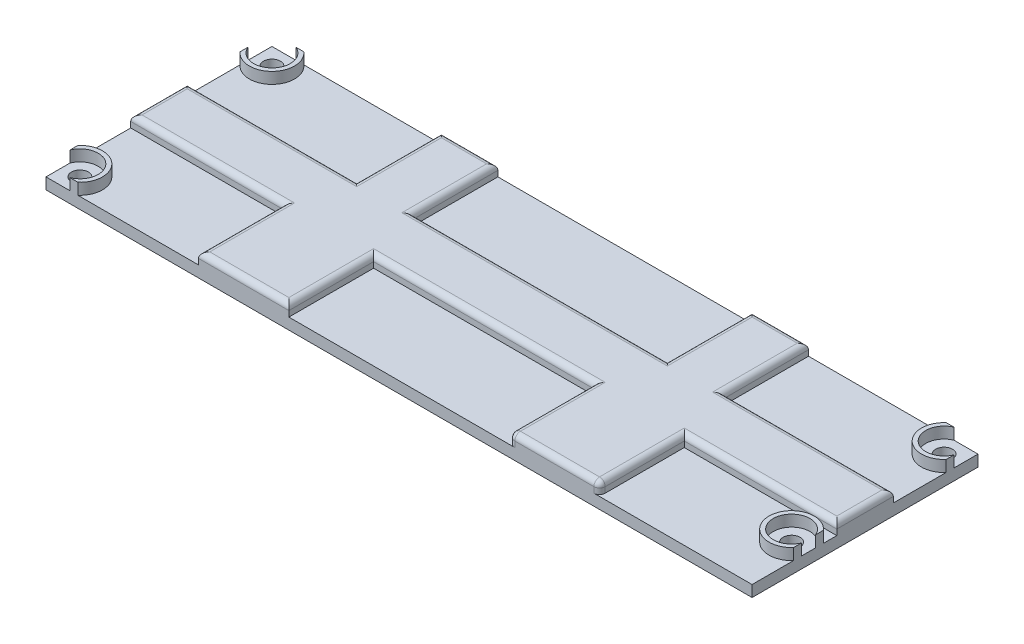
ISO-10303-21;
HEADER;
FILE_DESCRIPTION(('STEP AP214'),'2;1');
FILE_NAME('part.step','',(''),(''),'','','');
FILE_SCHEMA(('AUTOMOTIVE_DESIGN { 1 0 10303 214 1 1 1 1 }'));
ENDSEC;
DATA;
#1=APPLICATION_CONTEXT('core data for automotive mechanical design processes');
#2=APPLICATION_PROTOCOL_DEFINITION('international standard','automotive_design',2000,#1);
#3=PRODUCT_CONTEXT('',#1,'mechanical');
#4=PRODUCT('Part','Part','',(#3));
#5=PRODUCT_RELATED_PRODUCT_CATEGORY('part','',(#4));
#6=PRODUCT_DEFINITION_FORMATION('','',#4);
#7=PRODUCT_DEFINITION_CONTEXT('part definition',#1,'design');
#8=PRODUCT_DEFINITION('design','',#6,#7);
#9=PRODUCT_DEFINITION_SHAPE('','',#8);
#10=(LENGTH_UNIT() NAMED_UNIT(*) SI_UNIT(.MILLI.,.METRE.));
#11=(NAMED_UNIT(*) PLANE_ANGLE_UNIT() SI_UNIT($,.RADIAN.));
#12=(NAMED_UNIT(*) SI_UNIT($,.STERADIAN.) SOLID_ANGLE_UNIT());
#13=UNCERTAINTY_MEASURE_WITH_UNIT(LENGTH_MEASURE(1.E-05),#10,'distance_accuracy_value','');
#14=(GEOMETRIC_REPRESENTATION_CONTEXT(3) GLOBAL_UNCERTAINTY_ASSIGNED_CONTEXT((#13)) GLOBAL_UNIT_ASSIGNED_CONTEXT((#10,
#11,#12)) REPRESENTATION_CONTEXT('',''));
#15=CARTESIAN_POINT('',(0.,0.,0.));
#16=DIRECTION('',(0.,0.,1.));
#17=DIRECTION('',(1.,0.,0.));
#18=AXIS2_PLACEMENT_3D('',#15,#16,#17);
#19=CARTESIAN_POINT('',(0.,0.,0.));
#20=DIRECTION('',(0.,1.,0.));
#21=DIRECTION('',(0.,0.,1.));
#22=AXIS2_PLACEMENT_3D('',#19,#20,#21);
#23=PLANE('',#22);
#24=DIRECTION('',(-1.,0.,0.));
#25=VECTOR('',#24,1.);
#26=CARTESIAN_POINT('',(27.,0.,-15.));
#27=LINE('',#26,#25);
#28=CARTESIAN_POINT('',(27.,0.,-15.));
#29=VERTEX_POINT('',#28);
#30=CARTESIAN_POINT('',(0.,0.,-15.));
#31=VERTEX_POINT('',#30);
#32=EDGE_CURVE('E747',#29,#31,#27,.T.);
#33=ORIENTED_EDGE('',*,*,#32,.T.);
#34=DIRECTION('',(0.,0.,1.));
#35=VECTOR('',#34,1.);
#36=CARTESIAN_POINT('',(0.,0.,-40.));
#37=LINE('',#36,#35);
#38=CARTESIAN_POINT('',(0.,0.,-5.64575131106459));
#39=VERTEX_POINT('',#38);
#40=EDGE_CURVE('E486',#31,#39,#37,.T.);
#41=ORIENTED_EDGE('',*,*,#40,.T.);
#42=CARTESIAN_POINT('',(3.,0.,-3.));
#43=DIRECTION('',(0.,1.,0.));
#44=DIRECTION('',(0.,0.,1.));
#45=AXIS2_PLACEMENT_3D('',#42,#43,#44);
#46=CIRCLE('',#45,4.);
#47=CARTESIAN_POINT('',(5.6457513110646,0.,0.));
#48=VERTEX_POINT('',#47);
#49=EDGE_CURVE('E435',#48,#39,#46,.T.);
#50=ORIENTED_EDGE('',*,*,#49,.F.);
#51=DIRECTION('',(1.,0.,0.));
#52=VECTOR('',#51,1.);
#53=CARTESIAN_POINT('',(0.,0.,0.));
#54=LINE('',#53,#52);
#55=CARTESIAN_POINT('',(27.,0.,0.));
#56=VERTEX_POINT('',#55);
#57=EDGE_CURVE('E867',#48,#56,#54,.T.);
#58=ORIENTED_EDGE('',*,*,#57,.T.);
#59=DIRECTION('',(0.,0.,-1.));
#60=VECTOR('',#59,1.);
#61=CARTESIAN_POINT('',(27.,0.,0.));
#62=LINE('',#61,#60);
#63=EDGE_CURVE('E744',#56,#29,#62,.T.);
#64=ORIENTED_EDGE('',*,*,#63,.T.);
#65=EDGE_LOOP('',(#33,#41,#50,#58,#64));
#66=FACE_BOUND('',#65,.T.);
#67=ADVANCED_FACE('F39',(#66),#23,.T.);
#68=DIRECTION('',(0.,0.,1.));
#69=VECTOR('',#68,1.);
#70=CARTESIAN_POINT('',(43.,0.,-15.));
#71=LINE('',#70,#69);
#72=CARTESIAN_POINT('',(43.,0.,-15.));
#73=VERTEX_POINT('',#72);
#74=CARTESIAN_POINT('',(43.,0.,0.));
#75=VERTEX_POINT('',#74);
#76=EDGE_CURVE('E741',#73,#75,#71,.T.);
#77=ORIENTED_EDGE('',*,*,#76,.T.);
#78=CARTESIAN_POINT('',(83.,0.,0.));
#79=VERTEX_POINT('',#78);
#80=EDGE_CURVE('E708',#75,#79,#54,.T.);
#81=ORIENTED_EDGE('',*,*,#80,.T.);
#82=CARTESIAN_POINT('',(83.,0.,-1.));
#83=DIRECTION('',(0.,1.,0.));
#84=DIRECTION('',(0.,0.,1.));
#85=AXIS2_PLACEMENT_3D('',#82,#83,#84);
#86=CIRCLE('',#85,1.);
#87=CARTESIAN_POINT('',(82.,0.,-1.));
#88=VERTEX_POINT('',#87);
#89=EDGE_CURVE('E11',#79,#88,#86,.F.);
#90=ORIENTED_EDGE('',*,*,#89,.T.);
#91=DIRECTION('',(0.,0.,-1.));
#92=VECTOR('',#91,1.);
#93=CARTESIAN_POINT('',(82.,0.,0.));
#94=LINE('',#93,#92);
#95=CARTESIAN_POINT('',(82.,0.,-15.));
#96=VERTEX_POINT('',#95);
#97=EDGE_CURVE('E731',#88,#96,#94,.T.);
#98=ORIENTED_EDGE('',*,*,#97,.T.);
#99=DIRECTION('',(-1.,0.,0.));
#100=VECTOR('',#99,1.);
#101=CARTESIAN_POINT('',(82.,0.,-15.));
#102=LINE('',#101,#100);
#103=EDGE_CURVE('E733',#96,#73,#102,.T.);
#104=ORIENTED_EDGE('',*,*,#103,.T.);
#105=EDGE_LOOP('',(#77,#81,#90,#98,#104));
#106=FACE_BOUND('',#105,.T.);
#107=ADVANCED_FACE('F870',(#106),#23,.T.);
#108=DIRECTION('',(0.,0.,1.));
#109=VECTOR('',#108,1.);
#110=CARTESIAN_POINT('',(98.,0.,-15.));
#111=LINE('',#110,#109);
#112=CARTESIAN_POINT('',(98.,0.,-15.));
#113=VERTEX_POINT('',#112);
#114=CARTESIAN_POINT('',(98.,0.,-1.));
#115=VERTEX_POINT('',#114);
#116=EDGE_CURVE('E724',#113,#115,#111,.T.);
#117=ORIENTED_EDGE('',*,*,#116,.T.);
#118=CARTESIAN_POINT('',(97.,0.,-1.));
#119=DIRECTION('',(0.,1.,0.));
#120=DIRECTION('',(0.,0.,1.));
#121=AXIS2_PLACEMENT_3D('',#118,#119,#120);
#122=CIRCLE('',#121,1.);
#123=CARTESIAN_POINT('',(97.,0.,0.));
#124=VERTEX_POINT('',#123);
#125=EDGE_CURVE('E48',#115,#124,#122,.F.);
#126=ORIENTED_EDGE('',*,*,#125,.T.);
#127=CARTESIAN_POINT('',(125.,0.,0.));
#128=VERTEX_POINT('',#127);
#129=EDGE_CURVE('E508',#124,#128,#54,.T.);
#130=ORIENTED_EDGE('',*,*,#129,.T.);
#131=DIRECTION('',(0.,0.,-1.));
#132=VECTOR('',#131,1.);
#133=CARTESIAN_POINT('',(125.,0.,-40.));
#134=LINE('',#133,#132);
#135=CARTESIAN_POINT('',(125.,0.,-7.3542486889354));
#136=VERTEX_POINT('',#135);
#137=EDGE_CURVE('E522',#128,#136,#134,.T.);
#138=ORIENTED_EDGE('',*,*,#137,.T.);
#139=CARTESIAN_POINT('',(122.,0.,-10.));
#140=DIRECTION('',(0.,1.,0.));
#141=DIRECTION('',(0.,0.,1.));
#142=AXIS2_PLACEMENT_3D('',#139,#140,#141);
#143=CIRCLE('',#142,3.99999999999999);
#144=CARTESIAN_POINT('',(125.,0.,-12.6457513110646));
#145=VERTEX_POINT('',#144);
#146=EDGE_CURVE('E753',#145,#136,#143,.T.);
#147=ORIENTED_EDGE('',*,*,#146,.F.);
#148=CARTESIAN_POINT('',(125.,0.,-15.));
#149=VERTEX_POINT('',#148);
#150=EDGE_CURVE('E396',#145,#149,#134,.T.);
#151=ORIENTED_EDGE('',*,*,#150,.T.);
#152=DIRECTION('',(-1.,0.,0.));
#153=VECTOR('',#152,1.);
#154=CARTESIAN_POINT('',(125.,0.,-15.));
#155=LINE('',#154,#153);
#156=EDGE_CURVE('E730',#149,#113,#155,.T.);
#157=ORIENTED_EDGE('',*,*,#156,.T.);
#158=EDGE_LOOP('',(#117,#126,#130,#138,#147,#151,#157));
#159=FACE_BOUND('',#158,.T.);
#160=ADVANCED_FACE('F728',(#159),#23,.T.);
#161=DIRECTION('',(1.,0.,0.));
#162=VECTOR('',#161,1.);
#163=CARTESIAN_POINT('',(95.,0.,-25.));
#164=LINE('',#163,#162);
#165=CARTESIAN_POINT('',(95.,0.,-25.));
#166=VERTEX_POINT('',#165);
#167=CARTESIAN_POINT('',(125.,0.,-25.));
#168=VERTEX_POINT('',#167);
#169=EDGE_CURVE('E735',#166,#168,#164,.T.);
#170=ORIENTED_EDGE('',*,*,#169,.T.);
#171=CARTESIAN_POINT('',(125.,0.,-34.3542486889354));
#172=VERTEX_POINT('',#171);
#173=EDGE_CURVE('E864',#168,#172,#134,.T.);
#174=ORIENTED_EDGE('',*,*,#173,.T.);
#175=CARTESIAN_POINT('',(122.,0.,-37.));
#176=DIRECTION('',(0.,1.,0.));
#177=DIRECTION('',(0.,0.,1.));
#178=AXIS2_PLACEMENT_3D('',#175,#176,#177);
#179=CIRCLE('',#178,3.99999999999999);
#180=CARTESIAN_POINT('',(119.354248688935,0.,-40.));
#181=VERTEX_POINT('',#180);
#182=EDGE_CURVE('E397',#181,#172,#179,.T.);
#183=ORIENTED_EDGE('',*,*,#182,.F.);
#184=DIRECTION('',(-1.,0.,0.));
#185=VECTOR('',#184,1.);
#186=CARTESIAN_POINT('',(0.,0.,-40.));
#187=LINE('',#186,#185);
#188=CARTESIAN_POINT('',(95.,0.,-40.));
#189=VERTEX_POINT('',#188);
#190=EDGE_CURVE('E488',#181,#189,#187,.T.);
#191=ORIENTED_EDGE('',*,*,#190,.T.);
#192=DIRECTION('',(0.,0.,1.));
#193=VECTOR('',#192,1.);
#194=CARTESIAN_POINT('',(95.,0.,-40.));
#195=LINE('',#194,#193);
#196=EDGE_CURVE('E1541',#189,#166,#195,.T.);
#197=ORIENTED_EDGE('',*,*,#196,.T.);
#198=EDGE_LOOP('',(#170,#174,#183,#191,#197));
#199=FACE_BOUND('',#198,.T.);
#200=ADVANCED_FACE('F1403',(#199),#23,.T.);
#201=DIRECTION('',(0.,0.,-1.));
#202=VECTOR('',#201,1.);
#203=CARTESIAN_POINT('',(85.,0.,-25.));
#204=LINE('',#203,#202);
#205=CARTESIAN_POINT('',(85.,0.,-25.));
#206=VERTEX_POINT('',#205);
#207=CARTESIAN_POINT('',(85.,0.,-40.));
#208=VERTEX_POINT('',#207);
#209=EDGE_CURVE('E1603',#206,#208,#204,.T.);
#210=ORIENTED_EDGE('',*,*,#209,.T.);
#211=CARTESIAN_POINT('',(40.,0.,-40.));
#212=VERTEX_POINT('',#211);
#213=EDGE_CURVE('E532',#208,#212,#187,.T.);
#214=ORIENTED_EDGE('',*,*,#213,.T.);
#215=DIRECTION('',(0.,0.,1.));
#216=VECTOR('',#215,1.);
#217=CARTESIAN_POINT('',(40.,0.,-40.));
#218=LINE('',#217,#216);
#219=CARTESIAN_POINT('',(40.,0.,-25.));
#220=VERTEX_POINT('',#219);
#221=EDGE_CURVE('E1595',#212,#220,#218,.T.);
#222=ORIENTED_EDGE('',*,*,#221,.T.);
#223=DIRECTION('',(1.,0.,0.));
#224=VECTOR('',#223,1.);
#225=CARTESIAN_POINT('',(40.,0.,-25.));
#226=LINE('',#225,#224);
#227=EDGE_CURVE('E1600',#220,#206,#226,.T.);
#228=ORIENTED_EDGE('',*,*,#227,.T.);
#229=EDGE_LOOP('',(#210,#214,#222,#228));
#230=FACE_BOUND('',#229,.T.);
#231=ADVANCED_FACE('F1396',(#230),#23,.T.);
#232=DIRECTION('',(0.,0.,-1.));
#233=VECTOR('',#232,1.);
#234=CARTESIAN_POINT('',(30.,0.,-25.));
#235=LINE('',#234,#233);
#236=CARTESIAN_POINT('',(30.,0.,-25.));
#237=VERTEX_POINT('',#236);
#238=CARTESIAN_POINT('',(30.,0.,-40.));
#239=VERTEX_POINT('',#238);
#240=EDGE_CURVE('E1593',#237,#239,#235,.T.);
#241=ORIENTED_EDGE('',*,*,#240,.T.);
#242=CARTESIAN_POINT('',(5.6457513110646,0.,-40.));
#243=VERTEX_POINT('',#242);
#244=EDGE_CURVE('E534',#239,#243,#187,.T.);
#245=ORIENTED_EDGE('',*,*,#244,.T.);
#246=CARTESIAN_POINT('',(3.,0.,-37.));
#247=DIRECTION('',(0.,1.,0.));
#248=DIRECTION('',(0.,0.,1.));
#249=AXIS2_PLACEMENT_3D('',#246,#247,#248);
#250=CIRCLE('',#249,4.);
#251=CARTESIAN_POINT('',(0.,0.,-34.3542486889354));
#252=VERTEX_POINT('',#251);
#253=EDGE_CURVE('E462',#252,#243,#250,.T.);
#254=ORIENTED_EDGE('',*,*,#253,.F.);
#255=CARTESIAN_POINT('',(0.,0.,-25.));
#256=VERTEX_POINT('',#255);
#257=EDGE_CURVE('E501',#252,#256,#37,.T.);
#258=ORIENTED_EDGE('',*,*,#257,.T.);
#259=DIRECTION('',(1.,0.,0.));
#260=VECTOR('',#259,1.);
#261=CARTESIAN_POINT('',(0.,0.,-25.));
#262=LINE('',#261,#260);
#263=EDGE_CURVE('E667',#256,#237,#262,.T.);
#264=ORIENTED_EDGE('',*,*,#263,.T.);
#265=EDGE_LOOP('',(#241,#245,#254,#258,#264));
#266=FACE_BOUND('',#265,.T.);
#267=ADVANCED_FACE('F805',(#266),#23,.T.);
#268=CARTESIAN_POINT('',(122.,0.,-10.));
#269=DIRECTION('',(0.,1.,0.));
#270=DIRECTION('',(0.,0.,1.));
#271=AXIS2_PLACEMENT_3D('',#268,#269,#270);
#272=CIRCLE('',#271,3.25000000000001);
#273=CARTESIAN_POINT('',(125.,0.,-11.2500000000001));
#274=VERTEX_POINT('',#273);
#275=CARTESIAN_POINT('',(125.,0.,-8.74999999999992));
#276=VERTEX_POINT('',#275);
#277=EDGE_CURVE('E390',#274,#276,#272,.T.);
#278=ORIENTED_EDGE('',*,*,#277,.T.);
#279=EDGE_CURVE('E798',#276,#274,#134,.T.);
#280=ORIENTED_EDGE('',*,*,#279,.T.);
#281=EDGE_LOOP('',(#278,#280));
#282=FACE_BOUND('',#281,.T.);
#283=CARTESIAN_POINT('',(122.,0.,-10.));
#284=DIRECTION('',(0.,1.,0.));
#285=DIRECTION('',(0.,0.,1.));
#286=AXIS2_PLACEMENT_3D('',#283,#284,#285);
#287=CIRCLE('',#286,1.5);
#288=CARTESIAN_POINT('',(122.,0.,-8.5));
#289=VERTEX_POINT('',#288);
#290=EDGE_CURVE('E809',#289,#289,#287,.T.);
#291=ORIENTED_EDGE('',*,*,#290,.F.);
#292=EDGE_LOOP('',(#291));
#293=FACE_BOUND('',#292,.T.);
#294=ADVANCED_FACE('F801',(#282,#293),#23,.T.);
#295=CARTESIAN_POINT('',(122.,0.,-37.));
#296=DIRECTION('',(0.,1.,0.));
#297=DIRECTION('',(0.,0.,1.));
#298=AXIS2_PLACEMENT_3D('',#295,#296,#297);
#299=CIRCLE('',#298,3.25000000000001);
#300=CARTESIAN_POINT('',(120.75,0.,-40.));
#301=VERTEX_POINT('',#300);
#302=CARTESIAN_POINT('',(125.,0.,-35.75));
#303=VERTEX_POINT('',#302);
#304=EDGE_CURVE('E400',#301,#303,#299,.T.);
#305=ORIENTED_EDGE('',*,*,#304,.T.);
#306=CARTESIAN_POINT('',(125.,0.,-40.));
#307=VERTEX_POINT('',#306);
#308=EDGE_CURVE('E800',#303,#307,#134,.T.);
#309=ORIENTED_EDGE('',*,*,#308,.T.);
#310=EDGE_CURVE('E531',#307,#301,#187,.T.);
#311=ORIENTED_EDGE('',*,*,#310,.T.);
#312=EDGE_LOOP('',(#305,#309,#311));
#313=FACE_BOUND('',#312,.T.);
#314=CARTESIAN_POINT('',(122.,0.,-37.));
#315=DIRECTION('',(0.,1.,0.));
#316=DIRECTION('',(0.,0.,1.));
#317=AXIS2_PLACEMENT_3D('',#314,#315,#316);
#318=CIRCLE('',#317,1.5);
#319=CARTESIAN_POINT('',(122.,0.,-35.5));
#320=VERTEX_POINT('',#319);
#321=EDGE_CURVE('E815',#320,#320,#318,.T.);
#322=ORIENTED_EDGE('',*,*,#321,.F.);
#323=EDGE_LOOP('',(#322));
#324=FACE_BOUND('',#323,.T.);
#325=ADVANCED_FACE('F804',(#313,#324),#23,.T.);
#326=CARTESIAN_POINT('',(3.,0.,-37.));
#327=DIRECTION('',(0.,1.,0.));
#328=DIRECTION('',(0.,0.,1.));
#329=AXIS2_PLACEMENT_3D('',#326,#327,#328);
#330=CIRCLE('',#329,1.5);
#331=CARTESIAN_POINT('',(3.,0.,-35.5));
#332=VERTEX_POINT('',#331);
#333=EDGE_CURVE('E828',#332,#332,#330,.T.);
#334=ORIENTED_EDGE('',*,*,#333,.F.);
#335=EDGE_LOOP('',(#334));
#336=FACE_BOUND('',#335,.T.);
#337=CARTESIAN_POINT('',(0.,0.,-40.));
#338=VERTEX_POINT('',#337);
#339=CARTESIAN_POINT('',(0.,0.,-35.75));
#340=VERTEX_POINT('',#339);
#341=EDGE_CURVE('E506',#338,#340,#37,.T.);
#342=ORIENTED_EDGE('',*,*,#341,.T.);
#343=CARTESIAN_POINT('',(3.,0.,-37.));
#344=DIRECTION('',(0.,1.,0.));
#345=DIRECTION('',(0.,0.,1.));
#346=AXIS2_PLACEMENT_3D('',#343,#344,#345);
#347=CIRCLE('',#346,3.25);
#348=CARTESIAN_POINT('',(4.25000000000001,0.,-40.));
#349=VERTEX_POINT('',#348);
#350=EDGE_CURVE('E457',#340,#349,#347,.T.);
#351=ORIENTED_EDGE('',*,*,#350,.T.);
#352=EDGE_CURVE('E526',#349,#338,#187,.T.);
#353=ORIENTED_EDGE('',*,*,#352,.T.);
#354=EDGE_LOOP('',(#342,#351,#353));
#355=FACE_BOUND('',#354,.T.);
#356=ADVANCED_FACE('F862',(#336,#355),#23,.T.);
#357=CARTESIAN_POINT('',(0.,-2.,-40.));
#358=DIRECTION('',(-1.,0.,0.));
#359=DIRECTION('',(0.,0.,1.));
#360=AXIS2_PLACEMENT_3D('',#357,#358,#359);
#361=PLANE('',#360);
#362=DIRECTION('',(0.,-1.,0.));
#363=VECTOR('',#362,1.);
#364=CARTESIAN_POINT('',(0.,2.,-15.));
#365=LINE('',#364,#363);
#366=CARTESIAN_POINT('',(0.,1.,-15.));
#367=VERTEX_POINT('',#366);
#368=EDGE_CURVE('E751',#367,#31,#365,.T.);
#369=ORIENTED_EDGE('',*,*,#368,.F.);
#370=DIRECTION('',(0.,0.,-1.));
#371=VECTOR('',#370,1.);
#372=CARTESIAN_POINT('',(0.,1.,-25.));
#373=LINE('',#372,#371);
#374=CARTESIAN_POINT('',(0.,1.,-25.));
#375=VERTEX_POINT('',#374);
#376=EDGE_CURVE('E520',#367,#375,#373,.T.);
#377=ORIENTED_EDGE('',*,*,#376,.T.);
#378=DIRECTION('',(0.,-1.,0.));
#379=VECTOR('',#378,1.);
#380=CARTESIAN_POINT('',(0.,2.,-25.));
#381=LINE('',#380,#379);
#382=EDGE_CURVE('E750',#375,#256,#381,.T.);
#383=ORIENTED_EDGE('',*,*,#382,.T.);
#384=ORIENTED_EDGE('',*,*,#257,.F.);
#385=DIRECTION('',(0.,-1.,0.));
#386=VECTOR('',#385,1.);
#387=CARTESIAN_POINT('',(0.,2.,-34.3542486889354));
#388=LINE('',#387,#386);
#389=CARTESIAN_POINT('',(0.,2.,-34.3542486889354));
#390=VERTEX_POINT('',#389);
#391=EDGE_CURVE('E817',#390,#252,#388,.T.);
#392=ORIENTED_EDGE('',*,*,#391,.F.);
#393=DIRECTION('',(0.,0.,1.));
#394=VECTOR('',#393,1.);
#395=CARTESIAN_POINT('',(0.,2.,0.));
#396=LINE('',#395,#394);
#397=CARTESIAN_POINT('',(0.,2.,-35.75));
#398=VERTEX_POINT('',#397);
#399=EDGE_CURVE('E461',#398,#390,#396,.T.);
#400=ORIENTED_EDGE('',*,*,#399,.F.);
#401=DIRECTION('',(0.,-1.,0.));
#402=VECTOR('',#401,1.);
#403=CARTESIAN_POINT('',(0.,2.,-35.75));
#404=LINE('',#403,#402);
#405=EDGE_CURVE('E812',#398,#340,#404,.T.);
#406=ORIENTED_EDGE('',*,*,#405,.T.);
#407=ORIENTED_EDGE('',*,*,#341,.F.);
#408=DIRECTION('',(0.,1.,0.));
#409=VECTOR('',#408,1.);
#410=CARTESIAN_POINT('',(0.,-2.,-40.));
#411=LINE('',#410,#409);
#412=CARTESIAN_POINT('',(0.,-2.,-40.));
#413=VERTEX_POINT('',#412);
#414=EDGE_CURVE('E518',#413,#338,#411,.T.);
#415=ORIENTED_EDGE('',*,*,#414,.F.);
#416=DIRECTION('',(0.,0.,1.));
#417=VECTOR('',#416,1.);
#418=CARTESIAN_POINT('',(0.,-2.,-40.));
#419=LINE('',#418,#417);
#420=CARTESIAN_POINT('',(0.,-2.,0.));
#421=VERTEX_POINT('',#420);
#422=EDGE_CURVE('E835',#413,#421,#419,.T.);
#423=ORIENTED_EDGE('',*,*,#422,.T.);
#424=DIRECTION('',(0.,1.,0.));
#425=VECTOR('',#424,1.);
#426=CARTESIAN_POINT('',(0.,-2.,0.));
#427=LINE('',#426,#425);
#428=CARTESIAN_POINT('',(0.,0.,0.));
#429=VERTEX_POINT('',#428);
#430=EDGE_CURVE('E509',#421,#429,#427,.T.);
#431=ORIENTED_EDGE('',*,*,#430,.T.);
#432=CARTESIAN_POINT('',(0.,0.,-4.25));
#433=VERTEX_POINT('',#432);
#434=EDGE_CURVE('E483',#433,#429,#37,.T.);
#435=ORIENTED_EDGE('',*,*,#434,.F.);
#436=DIRECTION('',(0.,-1.,0.));
#437=VECTOR('',#436,1.);
#438=CARTESIAN_POINT('',(0.,2.,-4.25));
#439=LINE('',#438,#437);
#440=CARTESIAN_POINT('',(0.,2.,-4.25));
#441=VERTEX_POINT('',#440);
#442=EDGE_CURVE('E441',#441,#433,#439,.T.);
#443=ORIENTED_EDGE('',*,*,#442,.F.);
#444=DIRECTION('',(0.,0.,1.));
#445=VECTOR('',#444,1.);
#446=CARTESIAN_POINT('',(0.,2.,0.));
#447=LINE('',#446,#445);
#448=CARTESIAN_POINT('',(0.,2.,-5.64575131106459));
#449=VERTEX_POINT('',#448);
#450=EDGE_CURVE('E439',#449,#441,#447,.T.);
#451=ORIENTED_EDGE('',*,*,#450,.F.);
#452=DIRECTION('',(0.,-1.,0.));
#453=VECTOR('',#452,1.);
#454=CARTESIAN_POINT('',(0.,2.,-5.64575131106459));
#455=LINE('',#454,#453);
#456=EDGE_CURVE('E448',#449,#39,#455,.T.);
#457=ORIENTED_EDGE('',*,*,#456,.T.);
#458=ORIENTED_EDGE('',*,*,#40,.F.);
#459=EDGE_LOOP('',(#369,#377,#383,#384,#392,#400,#406,#407,#415,#423,#431,#435,#443,#451,#457,#458));
#460=FACE_BOUND('',#459,.T.);
#461=ADVANCED_FACE('F857',(#460),#361,.T.);
#462=CARTESIAN_POINT('',(0.,-2.,-40.));
#463=DIRECTION('',(0.,0.,-1.));
#464=DIRECTION('',(-1.,0.,0.));
#465=AXIS2_PLACEMENT_3D('',#462,#463,#464);
#466=PLANE('',#465);
#467=DIRECTION('',(0.,-1.,0.));
#468=VECTOR('',#467,1.);
#469=CARTESIAN_POINT('',(30.,2.,-40.));
#470=LINE('',#469,#468);
#471=CARTESIAN_POINT('',(30.,1.,-40.));
#472=VERTEX_POINT('',#471);
#473=EDGE_CURVE('E783',#472,#239,#470,.T.);
#474=ORIENTED_EDGE('',*,*,#473,.F.);
#475=DIRECTION('',(1.,0.,0.));
#476=VECTOR('',#475,1.);
#477=CARTESIAN_POINT('',(40.,1.,-40.));
#478=LINE('',#477,#476);
#479=CARTESIAN_POINT('',(40.,1.,-40.));
#480=VERTEX_POINT('',#479);
#481=EDGE_CURVE('E582',#472,#480,#478,.T.);
#482=ORIENTED_EDGE('',*,*,#481,.T.);
#483=DIRECTION('',(0.,-1.,0.));
#484=VECTOR('',#483,1.);
#485=CARTESIAN_POINT('',(40.,2.,-40.));
#486=LINE('',#485,#484);
#487=EDGE_CURVE('E781',#480,#212,#486,.T.);
#488=ORIENTED_EDGE('',*,*,#487,.T.);
#489=ORIENTED_EDGE('',*,*,#213,.F.);
#490=DIRECTION('',(0.,-1.,0.));
#491=VECTOR('',#490,1.);
#492=CARTESIAN_POINT('',(85.,2.,-40.));
#493=LINE('',#492,#491);
#494=CARTESIAN_POINT('',(85.,1.,-40.));
#495=VERTEX_POINT('',#494);
#496=EDGE_CURVE('E775',#495,#208,#493,.T.);
#497=ORIENTED_EDGE('',*,*,#496,.F.);
#498=DIRECTION('',(1.,0.,0.));
#499=VECTOR('',#498,1.);
#500=CARTESIAN_POINT('',(95.,1.,-40.));
#501=LINE('',#500,#499);
#502=CARTESIAN_POINT('',(95.,1.,-40.));
#503=VERTEX_POINT('',#502);
#504=EDGE_CURVE('E580',#495,#503,#501,.T.);
#505=ORIENTED_EDGE('',*,*,#504,.T.);
#506=DIRECTION('',(0.,-1.,0.));
#507=VECTOR('',#506,1.);
#508=CARTESIAN_POINT('',(95.,2.,-40.));
#509=LINE('',#508,#507);
#510=EDGE_CURVE('E773',#503,#189,#509,.T.);
#511=ORIENTED_EDGE('',*,*,#510,.T.);
#512=ORIENTED_EDGE('',*,*,#190,.F.);
#513=DIRECTION('',(0.,-1.,0.));
#514=VECTOR('',#513,1.);
#515=CARTESIAN_POINT('',(119.354248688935,2.,-40.));
#516=LINE('',#515,#514);
#517=CARTESIAN_POINT('',(119.354248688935,2.,-40.));
#518=VERTEX_POINT('',#517);
#519=EDGE_CURVE('E427',#518,#181,#516,.T.);
#520=ORIENTED_EDGE('',*,*,#519,.F.);
#521=DIRECTION('',(-1.,0.,0.));
#522=VECTOR('',#521,1.);
#523=CARTESIAN_POINT('',(0.,2.,-40.));
#524=LINE('',#523,#522);
#525=CARTESIAN_POINT('',(120.75,2.,-40.));
#526=VERTEX_POINT('',#525);
#527=EDGE_CURVE('E406',#526,#518,#524,.T.);
#528=ORIENTED_EDGE('',*,*,#527,.F.);
#529=DIRECTION('',(0.,-1.,0.));
#530=VECTOR('',#529,1.);
#531=CARTESIAN_POINT('',(120.75,2.,-40.));
#532=LINE('',#531,#530);
#533=EDGE_CURVE('E415',#526,#301,#532,.T.);
#534=ORIENTED_EDGE('',*,*,#533,.T.);
#535=ORIENTED_EDGE('',*,*,#310,.F.);
#536=DIRECTION('',(0.,1.,0.));
#537=VECTOR('',#536,1.);
#538=CARTESIAN_POINT('',(125.,-2.,-40.));
#539=LINE('',#538,#537);
#540=CARTESIAN_POINT('',(125.,-2.,-40.));
#541=VERTEX_POINT('',#540);
#542=EDGE_CURVE('E515',#541,#307,#539,.T.);
#543=ORIENTED_EDGE('',*,*,#542,.F.);
#544=DIRECTION('',(-1.,0.,0.));
#545=VECTOR('',#544,1.);
#546=CARTESIAN_POINT('',(0.,-2.,-40.));
#547=LINE('',#546,#545);
#548=EDGE_CURVE('E494',#541,#413,#547,.T.);
#549=ORIENTED_EDGE('',*,*,#548,.T.);
#550=ORIENTED_EDGE('',*,*,#414,.T.);
#551=ORIENTED_EDGE('',*,*,#352,.F.);
#552=DIRECTION('',(0.,-1.,0.));
#553=VECTOR('',#552,1.);
#554=CARTESIAN_POINT('',(4.25000000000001,2.,-40.));
#555=LINE('',#554,#553);
#556=CARTESIAN_POINT('',(4.25000000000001,2.,-40.));
#557=VERTEX_POINT('',#556);
#558=EDGE_CURVE('E468',#557,#349,#555,.T.);
#559=ORIENTED_EDGE('',*,*,#558,.F.);
#560=DIRECTION('',(-1.,0.,0.));
#561=VECTOR('',#560,1.);
#562=CARTESIAN_POINT('',(0.,2.,-40.));
#563=LINE('',#562,#561);
#564=CARTESIAN_POINT('',(5.6457513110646,2.,-40.));
#565=VERTEX_POINT('',#564);
#566=EDGE_CURVE('E466',#565,#557,#563,.T.);
#567=ORIENTED_EDGE('',*,*,#566,.F.);
#568=DIRECTION('',(0.,-1.,0.));
#569=VECTOR('',#568,1.);
#570=CARTESIAN_POINT('',(5.6457513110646,2.,-40.));
#571=LINE('',#570,#569);
#572=EDGE_CURVE('E480',#565,#243,#571,.T.);
#573=ORIENTED_EDGE('',*,*,#572,.T.);
#574=ORIENTED_EDGE('',*,*,#244,.F.);
#575=EDGE_LOOP('',(#474,#482,#488,#489,#497,#505,#511,#512,#520,#528,#534,#535,#543,#549,#550,
#551,#559,#567,#573,#574));
#576=FACE_BOUND('',#575,.T.);
#577=ADVANCED_FACE('F847',(#576),#466,.T.);
#578=CARTESIAN_POINT('',(125.,-2.,-40.));
#579=DIRECTION('',(1.,0.,0.));
#580=DIRECTION('',(0.,0.,-1.));
#581=AXIS2_PLACEMENT_3D('',#578,#579,#580);
#582=PLANE('',#581);
#583=DIRECTION('',(0.,-1.,0.));
#584=VECTOR('',#583,1.);
#585=CARTESIAN_POINT('',(125.,2.,-25.));
#586=LINE('',#585,#584);
#587=CARTESIAN_POINT('',(125.,1.,-25.));
#588=VERTEX_POINT('',#587);
#589=EDGE_CURVE('E769',#588,#168,#586,.T.);
#590=ORIENTED_EDGE('',*,*,#589,.F.);
#591=DIRECTION('',(0.,0.,1.));
#592=VECTOR('',#591,1.);
#593=CARTESIAN_POINT('',(125.,1.,-15.));
#594=LINE('',#593,#592);
#595=CARTESIAN_POINT('',(125.,1.,-15.));
#596=VERTEX_POINT('',#595);
#597=EDGE_CURVE('E592',#588,#596,#594,.T.);
#598=ORIENTED_EDGE('',*,*,#597,.T.);
#599=DIRECTION('',(0.,-1.,0.));
#600=VECTOR('',#599,1.);
#601=CARTESIAN_POINT('',(125.,2.,-15.));
#602=LINE('',#601,#600);
#603=EDGE_CURVE('E767',#596,#149,#602,.T.);
#604=ORIENTED_EDGE('',*,*,#603,.T.);
#605=ORIENTED_EDGE('',*,*,#150,.F.);
#606=DIRECTION('',(0.,-1.,0.));
#607=VECTOR('',#606,1.);
#608=CARTESIAN_POINT('',(125.,2.,-12.6457513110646));
#609=LINE('',#608,#607);
#610=CARTESIAN_POINT('',(125.,2.,-12.6457513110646));
#611=VERTEX_POINT('',#610);
#612=EDGE_CURVE('E375',#611,#145,#609,.T.);
#613=ORIENTED_EDGE('',*,*,#612,.F.);
#614=DIRECTION('',(0.,0.,-1.));
#615=VECTOR('',#614,1.);
#616=CARTESIAN_POINT('',(125.,2.,0.));
#617=LINE('',#616,#615);
#618=CARTESIAN_POINT('',(125.,2.,-11.2500000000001));
#619=VERTEX_POINT('',#618);
#620=EDGE_CURVE('E381',#619,#611,#617,.T.);
#621=ORIENTED_EDGE('',*,*,#620,.F.);
#622=DIRECTION('',(0.,-1.,0.));
#623=VECTOR('',#622,1.);
#624=CARTESIAN_POINT('',(125.,2.,-11.2500000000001));
#625=LINE('',#624,#623);
#626=EDGE_CURVE('E789',#619,#274,#625,.T.);
#627=ORIENTED_EDGE('',*,*,#626,.T.);
#628=ORIENTED_EDGE('',*,*,#279,.F.);
#629=DIRECTION('',(0.,-1.,0.));
#630=VECTOR('',#629,1.);
#631=CARTESIAN_POINT('',(125.,2.,-8.74999999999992));
#632=LINE('',#631,#630);
#633=CARTESIAN_POINT('',(125.,2.,-8.74999999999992));
#634=VERTEX_POINT('',#633);
#635=EDGE_CURVE('E402',#634,#276,#632,.T.);
#636=ORIENTED_EDGE('',*,*,#635,.F.);
#637=CARTESIAN_POINT('',(125.,2.,-7.3542486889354));
#638=VERTEX_POINT('',#637);
#639=EDGE_CURVE('E380',#638,#634,#617,.T.);
#640=ORIENTED_EDGE('',*,*,#639,.F.);
#641=DIRECTION('',(0.,-1.,0.));
#642=VECTOR('',#641,1.);
#643=CARTESIAN_POINT('',(125.,2.,-7.3542486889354));
#644=LINE('',#643,#642);
#645=EDGE_CURVE('E377',#638,#136,#644,.T.);
#646=ORIENTED_EDGE('',*,*,#645,.T.);
#647=ORIENTED_EDGE('',*,*,#137,.F.);
#648=DIRECTION('',(0.,1.,0.));
#649=VECTOR('',#648,1.);
#650=CARTESIAN_POINT('',(125.,-2.,0.));
#651=LINE('',#650,#649);
#652=CARTESIAN_POINT('',(125.,-2.,0.));
#653=VERTEX_POINT('',#652);
#654=EDGE_CURVE('E512',#653,#128,#651,.T.);
#655=ORIENTED_EDGE('',*,*,#654,.F.);
#656=DIRECTION('',(0.,0.,-1.));
#657=VECTOR('',#656,1.);
#658=CARTESIAN_POINT('',(125.,-2.,-40.));
#659=LINE('',#658,#657);
#660=EDGE_CURVE('E840',#653,#541,#659,.T.);
#661=ORIENTED_EDGE('',*,*,#660,.T.);
#662=ORIENTED_EDGE('',*,*,#542,.T.);
#663=ORIENTED_EDGE('',*,*,#308,.F.);
#664=DIRECTION('',(0.,-1.,0.));
#665=VECTOR('',#664,1.);
#666=CARTESIAN_POINT('',(125.,2.,-35.75));
#667=LINE('',#666,#665);
#668=CARTESIAN_POINT('',(125.,2.,-35.75));
#669=VERTEX_POINT('',#668);
#670=EDGE_CURVE('E421',#669,#303,#667,.T.);
#671=ORIENTED_EDGE('',*,*,#670,.F.);
#672=DIRECTION('',(0.,0.,-1.));
#673=VECTOR('',#672,1.);
#674=CARTESIAN_POINT('',(125.,2.,0.));
#675=LINE('',#674,#673);
#676=CARTESIAN_POINT('',(125.,2.,-34.3542486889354));
#677=VERTEX_POINT('',#676);
#678=EDGE_CURVE('E411',#677,#669,#675,.T.);
#679=ORIENTED_EDGE('',*,*,#678,.F.);
#680=DIRECTION('',(0.,-1.,0.));
#681=VECTOR('',#680,1.);
#682=CARTESIAN_POINT('',(125.,2.,-34.3542486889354));
#683=LINE('',#682,#681);
#684=EDGE_CURVE('E424',#677,#172,#683,.T.);
#685=ORIENTED_EDGE('',*,*,#684,.T.);
#686=ORIENTED_EDGE('',*,*,#173,.F.);
#687=EDGE_LOOP('',(#590,#598,#604,#605,#613,#621,#627,#628,#636,#640,#646,#647,#655,#661,#662,
#663,#671,#679,#685,#686));
#688=FACE_BOUND('',#687,.T.);
#689=ADVANCED_FACE('F394',(#688),#582,.T.);
#690=CARTESIAN_POINT('',(0.,-2.,0.));
#691=DIRECTION('',(0.,0.,1.));
#692=DIRECTION('',(1.,0.,0.));
#693=AXIS2_PLACEMENT_3D('',#690,#691,#692);
#694=PLANE('',#693);
#695=DIRECTION('',(0.,-1.,0.));
#696=VECTOR('',#695,1.);
#697=CARTESIAN_POINT('',(83.,-2.,0.));
#698=LINE('',#697,#696);
#699=CARTESIAN_POINT('',(83.,1.,0.));
#700=VERTEX_POINT('',#699);
#701=EDGE_CURVE('E672',#700,#79,#698,.T.);
#702=ORIENTED_EDGE('',*,*,#701,.T.);
#703=ORIENTED_EDGE('',*,*,#80,.F.);
#704=DIRECTION('',(0.,-1.,0.));
#705=VECTOR('',#704,1.);
#706=CARTESIAN_POINT('',(43.,2.,0.));
#707=LINE('',#706,#705);
#708=CARTESIAN_POINT('',(43.,1.,0.));
#709=VERTEX_POINT('',#708);
#710=EDGE_CURVE('E758',#709,#75,#707,.T.);
#711=ORIENTED_EDGE('',*,*,#710,.F.);
#712=DIRECTION('',(-1.,0.,0.));
#713=VECTOR('',#712,1.);
#714=CARTESIAN_POINT('',(27.,1.,0.));
#715=LINE('',#714,#713);
#716=CARTESIAN_POINT('',(27.,1.,0.));
#717=VERTEX_POINT('',#716);
#718=EDGE_CURVE('E601',#709,#717,#715,.T.);
#719=ORIENTED_EDGE('',*,*,#718,.T.);
#720=DIRECTION('',(0.,-1.,0.));
#721=VECTOR('',#720,1.);
#722=CARTESIAN_POINT('',(27.,2.,0.));
#723=LINE('',#722,#721);
#724=EDGE_CURVE('E756',#717,#56,#723,.T.);
#725=ORIENTED_EDGE('',*,*,#724,.T.);
#726=ORIENTED_EDGE('',*,*,#57,.F.);
#727=DIRECTION('',(0.,-1.,0.));
#728=VECTOR('',#727,1.);
#729=CARTESIAN_POINT('',(5.6457513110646,2.,0.));
#730=LINE('',#729,#728);
#731=CARTESIAN_POINT('',(5.6457513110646,2.,0.));
#732=VERTEX_POINT('',#731);
#733=EDGE_CURVE('E451',#732,#48,#730,.T.);
#734=ORIENTED_EDGE('',*,*,#733,.F.);
#735=DIRECTION('',(1.,0.,0.));
#736=VECTOR('',#735,1.);
#737=CARTESIAN_POINT('',(0.,2.,0.));
#738=LINE('',#737,#736);
#739=CARTESIAN_POINT('',(4.25000000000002,2.,0.));
#740=VERTEX_POINT('',#739);
#741=EDGE_CURVE('E434',#740,#732,#738,.T.);
#742=ORIENTED_EDGE('',*,*,#741,.F.);
#743=DIRECTION('',(0.,-1.,0.));
#744=VECTOR('',#743,1.);
#745=CARTESIAN_POINT('',(4.25000000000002,2.,0.));
#746=LINE('',#745,#744);
#747=CARTESIAN_POINT('',(4.25000000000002,0.,0.));
#748=VERTEX_POINT('',#747);
#749=EDGE_CURVE('E454',#740,#748,#746,.T.);
#750=ORIENTED_EDGE('',*,*,#749,.T.);
#751=EDGE_CURVE('E496',#429,#748,#54,.T.);
#752=ORIENTED_EDGE('',*,*,#751,.F.);
#753=ORIENTED_EDGE('',*,*,#430,.F.);
#754=DIRECTION('',(1.,0.,0.));
#755=VECTOR('',#754,1.);
#756=CARTESIAN_POINT('',(0.,-2.,0.));
#757=LINE('',#756,#755);
#758=EDGE_CURVE('E838',#421,#653,#757,.T.);
#759=ORIENTED_EDGE('',*,*,#758,.T.);
#760=ORIENTED_EDGE('',*,*,#654,.T.);
#761=ORIENTED_EDGE('',*,*,#129,.F.);
#762=DIRECTION('',(0.,-1.,0.));
#763=VECTOR('',#762,1.);
#764=CARTESIAN_POINT('',(97.,-2.,0.));
#765=LINE('',#764,#763);
#766=CARTESIAN_POINT('',(97.,1.,0.));
#767=VERTEX_POINT('',#766);
#768=EDGE_CURVE('E675',#124,#767,#765,.F.);
#769=ORIENTED_EDGE('',*,*,#768,.T.);
#770=DIRECTION('',(-1.,0.,0.));
#771=VECTOR('',#770,1.);
#772=CARTESIAN_POINT('',(83.,1.,0.));
#773=LINE('',#772,#771);
#774=EDGE_CURVE('E670',#767,#700,#773,.T.);
#775=ORIENTED_EDGE('',*,*,#774,.T.);
#776=EDGE_LOOP('',(#702,#703,#711,#719,#725,#726,#734,#742,#750,#752,#753,#759,#760,#761,#769,#775));
#777=FACE_BOUND('',#776,.T.);
#778=ADVANCED_FACE('F706',(#777),#694,.T.);
#779=CARTESIAN_POINT('',(0.,-2.,0.));
#780=DIRECTION('',(0.,1.,0.));
#781=DIRECTION('',(0.,0.,1.));
#782=AXIS2_PLACEMENT_3D('',#779,#780,#781);
#783=PLANE('',#782);
#784=CARTESIAN_POINT('',(122.,-2.,-10.));
#785=DIRECTION('',(0.,1.,0.));
#786=DIRECTION('',(0.,0.,1.));
#787=AXIS2_PLACEMENT_3D('',#784,#785,#786);
#788=CIRCLE('',#787,1.5);
#789=CARTESIAN_POINT('',(122.,-2.,-8.5));
#790=VERTEX_POINT('',#789);
#791=EDGE_CURVE('E811',#790,#790,#788,.T.);
#792=ORIENTED_EDGE('',*,*,#791,.T.);
#793=EDGE_LOOP('',(#792));
#794=FACE_BOUND('',#793,.T.);
#795=CARTESIAN_POINT('',(122.,-2.,-37.));
#796=DIRECTION('',(0.,1.,0.));
#797=DIRECTION('',(0.,0.,1.));
#798=AXIS2_PLACEMENT_3D('',#795,#796,#797);
#799=CIRCLE('',#798,1.5);
#800=CARTESIAN_POINT('',(122.,-2.,-35.5));
#801=VERTEX_POINT('',#800);
#802=EDGE_CURVE('E819',#801,#801,#799,.T.);
#803=ORIENTED_EDGE('',*,*,#802,.T.);
#804=EDGE_LOOP('',(#803));
#805=FACE_BOUND('',#804,.T.);
#806=CARTESIAN_POINT('',(3.,-2.,-3.));
#807=DIRECTION('',(0.,1.,0.));
#808=DIRECTION('',(0.,0.,1.));
#809=AXIS2_PLACEMENT_3D('',#806,#807,#808);
#810=CIRCLE('',#809,1.5);
#811=CARTESIAN_POINT('',(3.,-2.,-1.5));
#812=VERTEX_POINT('',#811);
#813=EDGE_CURVE('E825',#812,#812,#810,.T.);
#814=ORIENTED_EDGE('',*,*,#813,.T.);
#815=EDGE_LOOP('',(#814));
#816=FACE_BOUND('',#815,.T.);
#817=CARTESIAN_POINT('',(3.,-2.,-37.));
#818=DIRECTION('',(0.,1.,0.));
#819=DIRECTION('',(0.,0.,1.));
#820=AXIS2_PLACEMENT_3D('',#817,#818,#819);
#821=CIRCLE('',#820,1.5);
#822=CARTESIAN_POINT('',(3.,-2.,-35.5));
#823=VERTEX_POINT('',#822);
#824=EDGE_CURVE('E487',#823,#823,#821,.T.);
#825=ORIENTED_EDGE('',*,*,#824,.T.);
#826=EDGE_LOOP('',(#825));
#827=FACE_BOUND('',#826,.T.);
#828=ORIENTED_EDGE('',*,*,#422,.F.);
#829=ORIENTED_EDGE('',*,*,#548,.F.);
#830=ORIENTED_EDGE('',*,*,#660,.F.);
#831=ORIENTED_EDGE('',*,*,#758,.F.);
#832=EDGE_LOOP('',(#828,#829,#830,#831));
#833=FACE_BOUND('',#832,.T.);
#834=ADVANCED_FACE('F853',(#794,#805,#816,#827,#833),#783,.F.);
#835=CARTESIAN_POINT('',(3.,0.,-3.));
#836=DIRECTION('',(0.,1.,0.));
#837=DIRECTION('',(0.,0.,1.));
#838=AXIS2_PLACEMENT_3D('',#835,#836,#837);
#839=CIRCLE('',#838,3.25);
#840=EDGE_CURVE('E430',#748,#433,#839,.T.);
#841=ORIENTED_EDGE('',*,*,#840,.T.);
#842=ORIENTED_EDGE('',*,*,#434,.T.);
#843=ORIENTED_EDGE('',*,*,#751,.T.);
#844=EDGE_LOOP('',(#841,#842,#843));
#845=FACE_BOUND('',#844,.T.);
#846=CARTESIAN_POINT('',(3.,0.,-3.));
#847=DIRECTION('',(0.,1.,0.));
#848=DIRECTION('',(0.,0.,1.));
#849=AXIS2_PLACEMENT_3D('',#846,#847,#848);
#850=CIRCLE('',#849,1.5);
#851=CARTESIAN_POINT('',(3.,0.,-1.5));
#852=VERTEX_POINT('',#851);
#853=EDGE_CURVE('E822',#852,#852,#850,.T.);
#854=ORIENTED_EDGE('',*,*,#853,.F.);
#855=EDGE_LOOP('',(#854));
#856=FACE_BOUND('',#855,.T.);
#857=ADVANCED_FACE('F919',(#845,#856),#23,.T.);
#858=CARTESIAN_POINT('',(3.,-2.,-37.));
#859=DIRECTION('',(0.,1.,0.));
#860=DIRECTION('',(0.,0.,1.));
#861=AXIS2_PLACEMENT_3D('',#858,#859,#860);
#862=CYLINDRICAL_SURFACE('',#861,1.5);
#863=ORIENTED_EDGE('',*,*,#824,.F.);
#864=EDGE_LOOP('',(#863));
#865=FACE_BOUND('',#864,.T.);
#866=ORIENTED_EDGE('',*,*,#333,.T.);
#867=EDGE_LOOP('',(#866));
#868=FACE_BOUND('',#867,.T.);
#869=ADVANCED_FACE('F922',(#865,#868),#862,.F.);
#870=CARTESIAN_POINT('',(3.,-2.,-3.));
#871=DIRECTION('',(0.,1.,0.));
#872=DIRECTION('',(0.,0.,1.));
#873=AXIS2_PLACEMENT_3D('',#870,#871,#872);
#874=CYLINDRICAL_SURFACE('',#873,1.5);
#875=ORIENTED_EDGE('',*,*,#813,.F.);
#876=EDGE_LOOP('',(#875));
#877=FACE_BOUND('',#876,.T.);
#878=ORIENTED_EDGE('',*,*,#853,.T.);
#879=EDGE_LOOP('',(#878));
#880=FACE_BOUND('',#879,.T.);
#881=ADVANCED_FACE('F925',(#877,#880),#874,.F.);
#882=CARTESIAN_POINT('',(122.,-2.,-37.));
#883=DIRECTION('',(0.,1.,0.));
#884=DIRECTION('',(0.,0.,1.));
#885=AXIS2_PLACEMENT_3D('',#882,#883,#884);
#886=CYLINDRICAL_SURFACE('',#885,1.5);
#887=ORIENTED_EDGE('',*,*,#802,.F.);
#888=EDGE_LOOP('',(#887));
#889=FACE_BOUND('',#888,.T.);
#890=ORIENTED_EDGE('',*,*,#321,.T.);
#891=EDGE_LOOP('',(#890));
#892=FACE_BOUND('',#891,.T.);
#893=ADVANCED_FACE('F927',(#889,#892),#886,.F.);
#894=CARTESIAN_POINT('',(122.,-2.,-10.));
#895=DIRECTION('',(0.,1.,0.));
#896=DIRECTION('',(0.,0.,1.));
#897=AXIS2_PLACEMENT_3D('',#894,#895,#896);
#898=CYLINDRICAL_SURFACE('',#897,1.5);
#899=ORIENTED_EDGE('',*,*,#791,.F.);
#900=EDGE_LOOP('',(#899));
#901=FACE_BOUND('',#900,.T.);
#902=ORIENTED_EDGE('',*,*,#290,.T.);
#903=EDGE_LOOP('',(#902));
#904=FACE_BOUND('',#903,.T.);
#905=ADVANCED_FACE('F934',(#901,#904),#898,.F.);
#906=CARTESIAN_POINT('',(3.,2.,-37.));
#907=DIRECTION('',(0.,-1.,0.));
#908=DIRECTION('',(0.,0.,-1.));
#909=AXIS2_PLACEMENT_3D('',#906,#907,#908);
#910=CYLINDRICAL_SURFACE('',#909,3.25);
#911=ORIENTED_EDGE('',*,*,#350,.F.);
#912=ORIENTED_EDGE('',*,*,#405,.F.);
#913=CARTESIAN_POINT('',(3.,2.,-37.));
#914=DIRECTION('',(0.,1.,0.));
#915=DIRECTION('',(0.,0.,1.));
#916=AXIS2_PLACEMENT_3D('',#913,#914,#915);
#917=CIRCLE('',#916,3.25);
#918=EDGE_CURVE('E458',#398,#557,#917,.T.);
#919=ORIENTED_EDGE('',*,*,#918,.T.);
#920=ORIENTED_EDGE('',*,*,#558,.T.);
#921=EDGE_LOOP('',(#911,#912,#919,#920));
#922=FACE_BOUND('',#921,.T.);
#923=ADVANCED_FACE('F1312',(#922),#910,.F.);
#924=CARTESIAN_POINT('',(3.,2.,-37.));
#925=DIRECTION('',(0.,-1.,0.));
#926=DIRECTION('',(0.,0.,-1.));
#927=AXIS2_PLACEMENT_3D('',#924,#925,#926);
#928=CYLINDRICAL_SURFACE('',#927,4.);
#929=ORIENTED_EDGE('',*,*,#253,.T.);
#930=ORIENTED_EDGE('',*,*,#572,.F.);
#931=CARTESIAN_POINT('',(3.,2.,-37.));
#932=DIRECTION('',(0.,1.,0.));
#933=DIRECTION('',(0.,0.,1.));
#934=AXIS2_PLACEMENT_3D('',#931,#932,#933);
#935=CIRCLE('',#934,4.);
#936=EDGE_CURVE('E464',#390,#565,#935,.T.);
#937=ORIENTED_EDGE('',*,*,#936,.F.);
#938=ORIENTED_EDGE('',*,*,#391,.T.);
#939=EDGE_LOOP('',(#929,#930,#937,#938));
#940=FACE_BOUND('',#939,.T.);
#941=ADVANCED_FACE('F1304',(#940),#928,.T.);
#942=CARTESIAN_POINT('',(0.,2.,0.));
#943=DIRECTION('',(0.,1.,0.));
#944=DIRECTION('',(0.,0.,1.));
#945=AXIS2_PLACEMENT_3D('',#942,#943,#944);
#946=PLANE('',#945);
#947=ORIENTED_EDGE('',*,*,#918,.F.);
#948=ORIENTED_EDGE('',*,*,#399,.T.);
#949=ORIENTED_EDGE('',*,*,#936,.T.);
#950=ORIENTED_EDGE('',*,*,#566,.T.);
#951=EDGE_LOOP('',(#947,#948,#949,#950));
#952=FACE_BOUND('',#951,.T.);
#953=ADVANCED_FACE('F1296',(#952),#946,.T.);
#954=CARTESIAN_POINT('',(3.,2.,-3.));
#955=DIRECTION('',(0.,-1.,0.));
#956=DIRECTION('',(0.,0.,-1.));
#957=AXIS2_PLACEMENT_3D('',#954,#955,#956);
#958=CYLINDRICAL_SURFACE('',#957,3.25);
#959=ORIENTED_EDGE('',*,*,#840,.F.);
#960=ORIENTED_EDGE('',*,*,#749,.F.);
#961=CARTESIAN_POINT('',(3.,2.,-3.));
#962=DIRECTION('',(0.,1.,0.));
#963=DIRECTION('',(0.,0.,1.));
#964=AXIS2_PLACEMENT_3D('',#961,#962,#963);
#965=CIRCLE('',#964,3.25);
#966=EDGE_CURVE('E431',#740,#441,#965,.T.);
#967=ORIENTED_EDGE('',*,*,#966,.T.);
#968=ORIENTED_EDGE('',*,*,#442,.T.);
#969=EDGE_LOOP('',(#959,#960,#967,#968));
#970=FACE_BOUND('',#969,.T.);
#971=ADVANCED_FACE('F918',(#970),#958,.F.);
#972=CARTESIAN_POINT('',(3.,2.,-3.));
#973=DIRECTION('',(0.,-1.,0.));
#974=DIRECTION('',(0.,0.,-1.));
#975=AXIS2_PLACEMENT_3D('',#972,#973,#974);
#976=CYLINDRICAL_SURFACE('',#975,4.);
#977=ORIENTED_EDGE('',*,*,#49,.T.);
#978=ORIENTED_EDGE('',*,*,#456,.F.);
#979=CARTESIAN_POINT('',(3.,2.,-3.));
#980=DIRECTION('',(0.,1.,0.));
#981=DIRECTION('',(0.,0.,1.));
#982=AXIS2_PLACEMENT_3D('',#979,#980,#981);
#983=CIRCLE('',#982,4.);
#984=EDGE_CURVE('E437',#732,#449,#983,.T.);
#985=ORIENTED_EDGE('',*,*,#984,.F.);
#986=ORIENTED_EDGE('',*,*,#733,.T.);
#987=EDGE_LOOP('',(#977,#978,#985,#986));
#988=FACE_BOUND('',#987,.T.);
#989=ADVANCED_FACE('F909',(#988),#976,.T.);
#990=CARTESIAN_POINT('',(0.,2.,0.));
#991=DIRECTION('',(0.,1.,0.));
#992=DIRECTION('',(0.,0.,1.));
#993=AXIS2_PLACEMENT_3D('',#990,#991,#992);
#994=PLANE('',#993);
#995=ORIENTED_EDGE('',*,*,#966,.F.);
#996=ORIENTED_EDGE('',*,*,#741,.T.);
#997=ORIENTED_EDGE('',*,*,#984,.T.);
#998=ORIENTED_EDGE('',*,*,#450,.T.);
#999=EDGE_LOOP('',(#995,#996,#997,#998));
#1000=FACE_BOUND('',#999,.T.);
#1001=ADVANCED_FACE('F916',(#1000),#994,.T.);
#1002=CARTESIAN_POINT('',(122.,2.,-37.));
#1003=DIRECTION('',(0.,-1.,0.));
#1004=DIRECTION('',(0.,0.,-1.));
#1005=AXIS2_PLACEMENT_3D('',#1002,#1003,#1004);
#1006=CYLINDRICAL_SURFACE('',#1005,3.99999999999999);
#1007=ORIENTED_EDGE('',*,*,#182,.T.);
#1008=ORIENTED_EDGE('',*,*,#684,.F.);
#1009=CARTESIAN_POINT('',(122.,2.,-37.));
#1010=DIRECTION('',(0.,1.,0.));
#1011=DIRECTION('',(0.,0.,1.));
#1012=AXIS2_PLACEMENT_3D('',#1009,#1010,#1011);
#1013=CIRCLE('',#1012,3.99999999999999);
#1014=EDGE_CURVE('E409',#518,#677,#1013,.T.);
#1015=ORIENTED_EDGE('',*,*,#1014,.F.);
#1016=ORIENTED_EDGE('',*,*,#519,.T.);
#1017=EDGE_LOOP('',(#1007,#1008,#1015,#1016));
#1018=FACE_BOUND('',#1017,.T.);
#1019=ADVANCED_FACE('F1267',(#1018),#1006,.T.);
#1020=CARTESIAN_POINT('',(122.,2.,-37.));
#1021=DIRECTION('',(0.,-1.,0.));
#1022=DIRECTION('',(0.,0.,-1.));
#1023=AXIS2_PLACEMENT_3D('',#1020,#1021,#1022);
#1024=CYLINDRICAL_SURFACE('',#1023,3.25000000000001);
#1025=ORIENTED_EDGE('',*,*,#304,.F.);
#1026=ORIENTED_EDGE('',*,*,#533,.F.);
#1027=CARTESIAN_POINT('',(122.,2.,-37.));
#1028=DIRECTION('',(0.,1.,0.));
#1029=DIRECTION('',(0.,0.,1.));
#1030=AXIS2_PLACEMENT_3D('',#1027,#1028,#1029);
#1031=CIRCLE('',#1030,3.25000000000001);
#1032=EDGE_CURVE('E413',#526,#669,#1031,.T.);
#1033=ORIENTED_EDGE('',*,*,#1032,.T.);
#1034=ORIENTED_EDGE('',*,*,#670,.T.);
#1035=EDGE_LOOP('',(#1025,#1026,#1033,#1034));
#1036=FACE_BOUND('',#1035,.T.);
#1037=ADVANCED_FACE('F1259',(#1036),#1024,.F.);
#1038=CARTESIAN_POINT('',(0.,2.,0.));
#1039=DIRECTION('',(0.,1.,0.));
#1040=DIRECTION('',(0.,0.,1.));
#1041=AXIS2_PLACEMENT_3D('',#1038,#1039,#1040);
#1042=PLANE('',#1041);
#1043=ORIENTED_EDGE('',*,*,#527,.T.);
#1044=ORIENTED_EDGE('',*,*,#1014,.T.);
#1045=ORIENTED_EDGE('',*,*,#678,.T.);
#1046=ORIENTED_EDGE('',*,*,#1032,.F.);
#1047=EDGE_LOOP('',(#1043,#1044,#1045,#1046));
#1048=FACE_BOUND('',#1047,.T.);
#1049=ADVANCED_FACE('F1252',(#1048),#1042,.T.);
#1050=CARTESIAN_POINT('',(122.,2.,-10.));
#1051=DIRECTION('',(0.,-1.,0.));
#1052=DIRECTION('',(0.,0.,-1.));
#1053=AXIS2_PLACEMENT_3D('',#1050,#1051,#1052);
#1054=CYLINDRICAL_SURFACE('',#1053,3.99999999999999);
#1055=ORIENTED_EDGE('',*,*,#146,.T.);
#1056=ORIENTED_EDGE('',*,*,#645,.F.);
#1057=CARTESIAN_POINT('',(122.,2.,-10.));
#1058=DIRECTION('',(0.,1.,0.));
#1059=DIRECTION('',(0.,0.,1.));
#1060=AXIS2_PLACEMENT_3D('',#1057,#1058,#1059);
#1061=CIRCLE('',#1060,3.99999999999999);
#1062=EDGE_CURVE('E370',#611,#638,#1061,.T.);
#1063=ORIENTED_EDGE('',*,*,#1062,.F.);
#1064=ORIENTED_EDGE('',*,*,#612,.T.);
#1065=EDGE_LOOP('',(#1055,#1056,#1063,#1064));
#1066=FACE_BOUND('',#1065,.T.);
#1067=ADVANCED_FACE('F373',(#1066),#1054,.T.);
#1068=CARTESIAN_POINT('',(122.,2.,-10.));
#1069=DIRECTION('',(0.,-1.,0.));
#1070=DIRECTION('',(0.,0.,-1.));
#1071=AXIS2_PLACEMENT_3D('',#1068,#1069,#1070);
#1072=CYLINDRICAL_SURFACE('',#1071,3.25000000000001);
#1073=ORIENTED_EDGE('',*,*,#277,.F.);
#1074=ORIENTED_EDGE('',*,*,#626,.F.);
#1075=CARTESIAN_POINT('',(122.,2.,-10.));
#1076=DIRECTION('',(0.,1.,0.));
#1077=DIRECTION('',(0.,0.,1.));
#1078=AXIS2_PLACEMENT_3D('',#1075,#1076,#1077);
#1079=CIRCLE('',#1078,3.25000000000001);
#1080=EDGE_CURVE('E387',#619,#634,#1079,.T.);
#1081=ORIENTED_EDGE('',*,*,#1080,.T.);
#1082=ORIENTED_EDGE('',*,*,#635,.T.);
#1083=EDGE_LOOP('',(#1073,#1074,#1081,#1082));
#1084=FACE_BOUND('',#1083,.T.);
#1085=ADVANCED_FACE('F797',(#1084),#1072,.F.);
#1086=CARTESIAN_POINT('',(0.,2.,0.));
#1087=DIRECTION('',(0.,1.,0.));
#1088=DIRECTION('',(0.,0.,1.));
#1089=AXIS2_PLACEMENT_3D('',#1086,#1087,#1088);
#1090=PLANE('',#1089);
#1091=ORIENTED_EDGE('',*,*,#620,.T.);
#1092=ORIENTED_EDGE('',*,*,#1062,.T.);
#1093=ORIENTED_EDGE('',*,*,#639,.T.);
#1094=ORIENTED_EDGE('',*,*,#1080,.F.);
#1095=EDGE_LOOP('',(#1091,#1092,#1093,#1094));
#1096=FACE_BOUND('',#1095,.T.);
#1097=ADVANCED_FACE('F385',(#1096),#1090,.T.);
#1098=CARTESIAN_POINT('',(27.,2.,-15.));
#1099=DIRECTION('',(0.,0.,1.));
#1100=DIRECTION('',(1.,0.,0.));
#1101=AXIS2_PLACEMENT_3D('',#1098,#1099,#1100);
#1102=PLANE('',#1101);
#1103=DIRECTION('',(0.,-1.,0.));
#1104=VECTOR('',#1103,1.);
#1105=CARTESIAN_POINT('',(27.,2.,-15.));
#1106=LINE('',#1105,#1104);
#1107=CARTESIAN_POINT('',(27.,1.,-15.));
#1108=VERTEX_POINT('',#1107);
#1109=EDGE_CURVE('E754',#1108,#29,#1106,.T.);
#1110=ORIENTED_EDGE('',*,*,#1109,.F.);
#1111=DIRECTION('',(-1.,0.,0.));
#1112=VECTOR('',#1111,1.);
#1113=CARTESIAN_POINT('',(0.,1.,-15.));
#1114=LINE('',#1113,#1112);
#1115=EDGE_CURVE('E611',#1108,#367,#1114,.T.);
#1116=ORIENTED_EDGE('',*,*,#1115,.T.);
#1117=ORIENTED_EDGE('',*,*,#368,.T.);
#1118=ORIENTED_EDGE('',*,*,#32,.F.);
#1119=EDGE_LOOP('',(#1110,#1116,#1117,#1118));
#1120=FACE_BOUND('',#1119,.T.);
#1121=ADVANCED_FACE('F900',(#1120),#1102,.T.);
#1122=CARTESIAN_POINT('',(27.,2.,0.));
#1123=DIRECTION('',(-1.,0.,0.));
#1124=DIRECTION('',(0.,0.,1.));
#1125=AXIS2_PLACEMENT_3D('',#1122,#1123,#1124);
#1126=PLANE('',#1125);
#1127=ORIENTED_EDGE('',*,*,#724,.F.);
#1128=DIRECTION('',(0.,0.,-1.));
#1129=VECTOR('',#1128,1.);
#1130=CARTESIAN_POINT('',(27.,1.,-15.));
#1131=LINE('',#1130,#1129);
#1132=EDGE_CURVE('E609',#717,#1108,#1131,.T.);
#1133=ORIENTED_EDGE('',*,*,#1132,.T.);
#1134=ORIENTED_EDGE('',*,*,#1109,.T.);
#1135=ORIENTED_EDGE('',*,*,#63,.F.);
#1136=EDGE_LOOP('',(#1127,#1133,#1134,#1135));
#1137=FACE_BOUND('',#1136,.T.);
#1138=ADVANCED_FACE('F896',(#1137),#1126,.T.);
#1139=CARTESIAN_POINT('',(43.,2.,-15.));
#1140=DIRECTION('',(1.,0.,0.));
#1141=DIRECTION('',(0.,0.,-1.));
#1142=AXIS2_PLACEMENT_3D('',#1139,#1140,#1141);
#1143=PLANE('',#1142);
#1144=DIRECTION('',(0.,-1.,0.));
#1145=VECTOR('',#1144,1.);
#1146=CARTESIAN_POINT('',(43.,2.,-15.));
#1147=LINE('',#1146,#1145);
#1148=CARTESIAN_POINT('',(43.,1.,-15.));
#1149=VERTEX_POINT('',#1148);
#1150=EDGE_CURVE('E760',#1149,#73,#1147,.T.);
#1151=ORIENTED_EDGE('',*,*,#1150,.F.);
#1152=DIRECTION('',(0.,0.,1.));
#1153=VECTOR('',#1152,1.);
#1154=CARTESIAN_POINT('',(43.,1.,0.));
#1155=LINE('',#1154,#1153);
#1156=EDGE_CURVE('E607',#1149,#709,#1155,.T.);
#1157=ORIENTED_EDGE('',*,*,#1156,.T.);
#1158=ORIENTED_EDGE('',*,*,#710,.T.);
#1159=ORIENTED_EDGE('',*,*,#76,.F.);
#1160=EDGE_LOOP('',(#1151,#1157,#1158,#1159));
#1161=FACE_BOUND('',#1160,.T.);
#1162=ADVANCED_FACE('F875',(#1161),#1143,.T.);
#1163=CARTESIAN_POINT('',(82.,2.,-15.));
#1164=DIRECTION('',(0.,0.,1.));
#1165=DIRECTION('',(1.,0.,0.));
#1166=AXIS2_PLACEMENT_3D('',#1163,#1164,#1165);
#1167=PLANE('',#1166);
#1168=DIRECTION('',(0.,-1.,0.));
#1169=VECTOR('',#1168,1.);
#1170=CARTESIAN_POINT('',(82.,2.,-15.));
#1171=LINE('',#1170,#1169);
#1172=CARTESIAN_POINT('',(82.,1.,-15.));
#1173=VERTEX_POINT('',#1172);
#1174=EDGE_CURVE('E762',#1173,#96,#1171,.T.);
#1175=ORIENTED_EDGE('',*,*,#1174,.F.);
#1176=DIRECTION('',(-1.,0.,0.));
#1177=VECTOR('',#1176,1.);
#1178=CARTESIAN_POINT('',(43.,1.,-15.));
#1179=LINE('',#1178,#1177);
#1180=EDGE_CURVE('E605',#1173,#1149,#1179,.T.);
#1181=ORIENTED_EDGE('',*,*,#1180,.T.);
#1182=ORIENTED_EDGE('',*,*,#1150,.T.);
#1183=ORIENTED_EDGE('',*,*,#103,.F.);
#1184=EDGE_LOOP('',(#1175,#1181,#1182,#1183));
#1185=FACE_BOUND('',#1184,.T.);
#1186=ADVANCED_FACE('F1206',(#1185),#1167,.T.);
#1187=CARTESIAN_POINT('',(82.,2.,0.));
#1188=DIRECTION('',(-1.,0.,0.));
#1189=DIRECTION('',(0.,0.,1.));
#1190=AXIS2_PLACEMENT_3D('',#1187,#1188,#1189);
#1191=PLANE('',#1190);
#1192=ORIENTED_EDGE('',*,*,#97,.F.);
#1193=DIRECTION('',(0.,-1.,0.));
#1194=VECTOR('',#1193,1.);
#1195=CARTESIAN_POINT('',(82.,2.,-1.));
#1196=LINE('',#1195,#1194);
#1197=CARTESIAN_POINT('',(82.,1.,-1.));
#1198=VERTEX_POINT('',#1197);
#1199=EDGE_CURVE('E679',#88,#1198,#1196,.F.);
#1200=ORIENTED_EDGE('',*,*,#1199,.T.);
#1201=DIRECTION('',(0.,0.,-1.));
#1202=VECTOR('',#1201,1.);
#1203=CARTESIAN_POINT('',(82.,1.,-15.));
#1204=LINE('',#1203,#1202);
#1205=EDGE_CURVE('E603',#1198,#1173,#1204,.T.);
#1206=ORIENTED_EDGE('',*,*,#1205,.T.);
#1207=ORIENTED_EDGE('',*,*,#1174,.T.);
#1208=EDGE_LOOP('',(#1192,#1200,#1206,#1207));
#1209=FACE_BOUND('',#1208,.T.);
#1210=ADVANCED_FACE('F1197',(#1209),#1191,.T.);
#1211=CARTESIAN_POINT('',(98.,2.,-15.));
#1212=DIRECTION('',(1.,0.,0.));
#1213=DIRECTION('',(0.,0.,-1.));
#1214=AXIS2_PLACEMENT_3D('',#1211,#1212,#1213);
#1215=PLANE('',#1214);
#1216=DIRECTION('',(0.,0.,1.));
#1217=VECTOR('',#1216,1.);
#1218=CARTESIAN_POINT('',(98.,1.,0.));
#1219=LINE('',#1218,#1217);
#1220=CARTESIAN_POINT('',(98.,1.,-15.));
#1221=VERTEX_POINT('',#1220);
#1222=CARTESIAN_POINT('',(98.,1.,-1.));
#1223=VERTEX_POINT('',#1222);
#1224=EDGE_CURVE('E598',#1221,#1223,#1219,.T.);
#1225=ORIENTED_EDGE('',*,*,#1224,.T.);
#1226=DIRECTION('',(0.,-1.,0.));
#1227=VECTOR('',#1226,1.);
#1228=CARTESIAN_POINT('',(98.,2.,-1.));
#1229=LINE('',#1228,#1227);
#1230=EDGE_CURVE('E613',#1223,#115,#1229,.T.);
#1231=ORIENTED_EDGE('',*,*,#1230,.T.);
#1232=ORIENTED_EDGE('',*,*,#116,.F.);
#1233=DIRECTION('',(0.,-1.,0.));
#1234=VECTOR('',#1233,1.);
#1235=CARTESIAN_POINT('',(98.,2.,-15.));
#1236=LINE('',#1235,#1234);
#1237=EDGE_CURVE('E765',#1221,#113,#1236,.T.);
#1238=ORIENTED_EDGE('',*,*,#1237,.F.);
#1239=EDGE_LOOP('',(#1225,#1231,#1232,#1238));
#1240=FACE_BOUND('',#1239,.T.);
#1241=ADVANCED_FACE('F722',(#1240),#1215,.T.);
#1242=CARTESIAN_POINT('',(125.,2.,-15.));
#1243=DIRECTION('',(0.,0.,1.));
#1244=DIRECTION('',(1.,0.,0.));
#1245=AXIS2_PLACEMENT_3D('',#1242,#1243,#1244);
#1246=PLANE('',#1245);
#1247=ORIENTED_EDGE('',*,*,#603,.F.);
#1248=DIRECTION('',(-1.,0.,0.));
#1249=VECTOR('',#1248,1.);
#1250=CARTESIAN_POINT('',(98.,1.,-15.));
#1251=LINE('',#1250,#1249);
#1252=EDGE_CURVE('E596',#596,#1221,#1251,.T.);
#1253=ORIENTED_EDGE('',*,*,#1252,.T.);
#1254=ORIENTED_EDGE('',*,*,#1237,.T.);
#1255=ORIENTED_EDGE('',*,*,#156,.F.);
#1256=EDGE_LOOP('',(#1247,#1253,#1254,#1255));
#1257=FACE_BOUND('',#1256,.T.);
#1258=ADVANCED_FACE('F1181',(#1257),#1246,.T.);
#1259=CARTESIAN_POINT('',(95.,2.,-25.));
#1260=DIRECTION('',(0.,0.,-1.));
#1261=DIRECTION('',(-1.,0.,0.));
#1262=AXIS2_PLACEMENT_3D('',#1259,#1260,#1261);
#1263=PLANE('',#1262);
#1264=DIRECTION('',(0.,-1.,0.));
#1265=VECTOR('',#1264,1.);
#1266=CARTESIAN_POINT('',(95.,2.,-25.));
#1267=LINE('',#1266,#1265);
#1268=CARTESIAN_POINT('',(95.,1.,-25.));
#1269=VERTEX_POINT('',#1268);
#1270=EDGE_CURVE('E771',#1269,#166,#1267,.T.);
#1271=ORIENTED_EDGE('',*,*,#1270,.F.);
#1272=DIRECTION('',(1.,0.,0.));
#1273=VECTOR('',#1272,1.);
#1274=CARTESIAN_POINT('',(125.,1.,-25.));
#1275=LINE('',#1274,#1273);
#1276=EDGE_CURVE('E594',#1269,#588,#1275,.T.);
#1277=ORIENTED_EDGE('',*,*,#1276,.T.);
#1278=ORIENTED_EDGE('',*,*,#589,.T.);
#1279=ORIENTED_EDGE('',*,*,#169,.F.);
#1280=EDGE_LOOP('',(#1271,#1277,#1278,#1279));
#1281=FACE_BOUND('',#1280,.T.);
#1282=ADVANCED_FACE('F1173',(#1281),#1263,.T.);
#1283=CARTESIAN_POINT('',(95.,2.,-40.));
#1284=DIRECTION('',(1.,0.,0.));
#1285=DIRECTION('',(0.,0.,-1.));
#1286=AXIS2_PLACEMENT_3D('',#1283,#1284,#1285);
#1287=PLANE('',#1286);
#1288=ORIENTED_EDGE('',*,*,#510,.F.);
#1289=DIRECTION('',(0.,0.,1.));
#1290=VECTOR('',#1289,1.);
#1291=CARTESIAN_POINT('',(95.,1.,-25.));
#1292=LINE('',#1291,#1290);
#1293=EDGE_CURVE('E590',#503,#1269,#1292,.T.);
#1294=ORIENTED_EDGE('',*,*,#1293,.T.);
#1295=ORIENTED_EDGE('',*,*,#1270,.T.);
#1296=ORIENTED_EDGE('',*,*,#196,.F.);
#1297=EDGE_LOOP('',(#1288,#1294,#1295,#1296));
#1298=FACE_BOUND('',#1297,.T.);
#1299=ADVANCED_FACE('F1165',(#1298),#1287,.T.);
#1300=CARTESIAN_POINT('',(85.,2.,-25.));
#1301=DIRECTION('',(-1.,0.,0.));
#1302=DIRECTION('',(0.,0.,1.));
#1303=AXIS2_PLACEMENT_3D('',#1300,#1301,#1302);
#1304=PLANE('',#1303);
#1305=DIRECTION('',(0.,-1.,0.));
#1306=VECTOR('',#1305,1.);
#1307=CARTESIAN_POINT('',(85.,2.,-25.));
#1308=LINE('',#1307,#1306);
#1309=CARTESIAN_POINT('',(85.,1.,-25.));
#1310=VERTEX_POINT('',#1309);
#1311=EDGE_CURVE('E777',#1310,#206,#1308,.T.);
#1312=ORIENTED_EDGE('',*,*,#1311,.F.);
#1313=DIRECTION('',(0.,0.,-1.));
#1314=VECTOR('',#1313,1.);
#1315=CARTESIAN_POINT('',(85.,1.,-40.));
#1316=LINE('',#1315,#1314);
#1317=EDGE_CURVE('E588',#1310,#495,#1316,.T.);
#1318=ORIENTED_EDGE('',*,*,#1317,.T.);
#1319=ORIENTED_EDGE('',*,*,#496,.T.);
#1320=ORIENTED_EDGE('',*,*,#209,.F.);
#1321=EDGE_LOOP('',(#1312,#1318,#1319,#1320));
#1322=FACE_BOUND('',#1321,.T.);
#1323=ADVANCED_FACE('F1157',(#1322),#1304,.T.);
#1324=CARTESIAN_POINT('',(40.,2.,-25.));
#1325=DIRECTION('',(0.,0.,-1.));
#1326=DIRECTION('',(-1.,0.,0.));
#1327=AXIS2_PLACEMENT_3D('',#1324,#1325,#1326);
#1328=PLANE('',#1327);
#1329=DIRECTION('',(0.,-1.,0.));
#1330=VECTOR('',#1329,1.);
#1331=CARTESIAN_POINT('',(40.,2.,-25.));
#1332=LINE('',#1331,#1330);
#1333=CARTESIAN_POINT('',(40.,1.,-25.));
#1334=VERTEX_POINT('',#1333);
#1335=EDGE_CURVE('E779',#1334,#220,#1332,.T.);
#1336=ORIENTED_EDGE('',*,*,#1335,.F.);
#1337=DIRECTION('',(1.,0.,0.));
#1338=VECTOR('',#1337,1.);
#1339=CARTESIAN_POINT('',(85.,1.,-25.));
#1340=LINE('',#1339,#1338);
#1341=EDGE_CURVE('E586',#1334,#1310,#1340,.T.);
#1342=ORIENTED_EDGE('',*,*,#1341,.T.);
#1343=ORIENTED_EDGE('',*,*,#1311,.T.);
#1344=ORIENTED_EDGE('',*,*,#227,.F.);
#1345=EDGE_LOOP('',(#1336,#1342,#1343,#1344));
#1346=FACE_BOUND('',#1345,.T.);
#1347=ADVANCED_FACE('F1149',(#1346),#1328,.T.);
#1348=CARTESIAN_POINT('',(40.,2.,-40.));
#1349=DIRECTION('',(1.,0.,0.));
#1350=DIRECTION('',(0.,0.,-1.));
#1351=AXIS2_PLACEMENT_3D('',#1348,#1349,#1350);
#1352=PLANE('',#1351);
#1353=ORIENTED_EDGE('',*,*,#487,.F.);
#1354=DIRECTION('',(0.,0.,1.));
#1355=VECTOR('',#1354,1.);
#1356=CARTESIAN_POINT('',(40.,1.,-25.));
#1357=LINE('',#1356,#1355);
#1358=EDGE_CURVE('E584',#480,#1334,#1357,.T.);
#1359=ORIENTED_EDGE('',*,*,#1358,.T.);
#1360=ORIENTED_EDGE('',*,*,#1335,.T.);
#1361=ORIENTED_EDGE('',*,*,#221,.F.);
#1362=EDGE_LOOP('',(#1353,#1359,#1360,#1361));
#1363=FACE_BOUND('',#1362,.T.);
#1364=ADVANCED_FACE('F1141',(#1363),#1352,.T.);
#1365=CARTESIAN_POINT('',(30.,2.,-25.));
#1366=DIRECTION('',(-1.,0.,0.));
#1367=DIRECTION('',(0.,0.,1.));
#1368=AXIS2_PLACEMENT_3D('',#1365,#1366,#1367);
#1369=PLANE('',#1368);
#1370=DIRECTION('',(0.,-1.,0.));
#1371=VECTOR('',#1370,1.);
#1372=CARTESIAN_POINT('',(30.,2.,-25.));
#1373=LINE('',#1372,#1371);
#1374=CARTESIAN_POINT('',(30.,1.,-25.));
#1375=VERTEX_POINT('',#1374);
#1376=EDGE_CURVE('E785',#1375,#237,#1373,.T.);
#1377=ORIENTED_EDGE('',*,*,#1376,.F.);
#1378=DIRECTION('',(0.,0.,-1.));
#1379=VECTOR('',#1378,1.);
#1380=CARTESIAN_POINT('',(30.,1.,-40.));
#1381=LINE('',#1380,#1379);
#1382=EDGE_CURVE('E578',#1375,#472,#1381,.T.);
#1383=ORIENTED_EDGE('',*,*,#1382,.T.);
#1384=ORIENTED_EDGE('',*,*,#473,.T.);
#1385=ORIENTED_EDGE('',*,*,#240,.F.);
#1386=EDGE_LOOP('',(#1377,#1383,#1384,#1385));
#1387=FACE_BOUND('',#1386,.T.);
#1388=ADVANCED_FACE('F1134',(#1387),#1369,.T.);
#1389=CARTESIAN_POINT('',(0.,2.,-25.));
#1390=DIRECTION('',(0.,0.,-1.));
#1391=DIRECTION('',(-1.,0.,0.));
#1392=AXIS2_PLACEMENT_3D('',#1389,#1390,#1391);
#1393=PLANE('',#1392);
#1394=ORIENTED_EDGE('',*,*,#382,.F.);
#1395=DIRECTION('',(1.,0.,0.));
#1396=VECTOR('',#1395,1.);
#1397=CARTESIAN_POINT('',(30.,1.,-25.));
#1398=LINE('',#1397,#1396);
#1399=EDGE_CURVE('E576',#375,#1375,#1398,.T.);
#1400=ORIENTED_EDGE('',*,*,#1399,.T.);
#1401=ORIENTED_EDGE('',*,*,#1376,.T.);
#1402=ORIENTED_EDGE('',*,*,#263,.F.);
#1403=EDGE_LOOP('',(#1394,#1400,#1401,#1402));
#1404=FACE_BOUND('',#1403,.T.);
#1405=ADVANCED_FACE('F1124',(#1404),#1393,.T.);
#1406=CARTESIAN_POINT('',(0.,2.,0.));
#1407=DIRECTION('',(0.,-1.,0.));
#1408=DIRECTION('',(0.,0.,-1.));
#1409=AXIS2_PLACEMENT_3D('',#1406,#1407,#1408);
#1410=PLANE('',#1409);
#1411=DIRECTION('',(0.,0.,-1.));
#1412=VECTOR('',#1411,1.);
#1413=CARTESIAN_POINT('',(83.,2.,0.));
#1414=LINE('',#1413,#1412);
#1415=CARTESIAN_POINT('',(83.,2.,-16.));
#1416=VERTEX_POINT('',#1415);
#1417=CARTESIAN_POINT('',(83.,2.,-1.));
#1418=VERTEX_POINT('',#1417);
#1419=EDGE_CURVE('E548',#1416,#1418,#1414,.F.);
#1420=ORIENTED_EDGE('',*,*,#1419,.T.);
#1421=DIRECTION('',(-1.,0.,0.));
#1422=VECTOR('',#1421,1.);
#1423=CARTESIAN_POINT('',(97.,2.,-1.));
#1424=LINE('',#1423,#1422);
#1425=CARTESIAN_POINT('',(97.,2.,-1.));
#1426=VERTEX_POINT('',#1425);
#1427=EDGE_CURVE('E682',#1418,#1426,#1424,.F.);
#1428=ORIENTED_EDGE('',*,*,#1427,.T.);
#1429=DIRECTION('',(0.,0.,1.));
#1430=VECTOR('',#1429,1.);
#1431=CARTESIAN_POINT('',(97.,2.,-15.));
#1432=LINE('',#1431,#1430);
#1433=CARTESIAN_POINT('',(97.,2.,-16.));
#1434=VERTEX_POINT('',#1433);
#1435=EDGE_CURVE('E574',#1426,#1434,#1432,.F.);
#1436=ORIENTED_EDGE('',*,*,#1435,.T.);
#1437=DIRECTION('',(-1.,0.,0.));
#1438=VECTOR('',#1437,1.);
#1439=CARTESIAN_POINT('',(125.,2.,-16.));
#1440=LINE('',#1439,#1438);
#1441=CARTESIAN_POINT('',(124.,2.,-16.));
#1442=VERTEX_POINT('',#1441);
#1443=EDGE_CURVE('E572',#1434,#1442,#1440,.F.);
#1444=ORIENTED_EDGE('',*,*,#1443,.T.);
#1445=DIRECTION('',(0.,0.,1.));
#1446=VECTOR('',#1445,1.);
#1447=CARTESIAN_POINT('',(124.,2.,-25.));
#1448=LINE('',#1447,#1446);
#1449=CARTESIAN_POINT('',(124.,2.,-24.));
#1450=VERTEX_POINT('',#1449);
#1451=EDGE_CURVE('E570',#1442,#1450,#1448,.F.);
#1452=ORIENTED_EDGE('',*,*,#1451,.T.);
#1453=DIRECTION('',(1.,0.,0.));
#1454=VECTOR('',#1453,1.);
#1455=CARTESIAN_POINT('',(95.,2.,-24.));
#1456=LINE('',#1455,#1454);
#1457=CARTESIAN_POINT('',(94.,2.,-24.));
#1458=VERTEX_POINT('',#1457);
#1459=EDGE_CURVE('E568',#1450,#1458,#1456,.F.);
#1460=ORIENTED_EDGE('',*,*,#1459,.T.);
#1461=DIRECTION('',(0.,0.,1.));
#1462=VECTOR('',#1461,1.);
#1463=CARTESIAN_POINT('',(94.,2.,-40.));
#1464=LINE('',#1463,#1462);
#1465=CARTESIAN_POINT('',(94.,2.,-39.));
#1466=VERTEX_POINT('',#1465);
#1467=EDGE_CURVE('E566',#1458,#1466,#1464,.F.);
#1468=ORIENTED_EDGE('',*,*,#1467,.T.);
#1469=DIRECTION('',(1.,0.,0.));
#1470=VECTOR('',#1469,1.);
#1471=CARTESIAN_POINT('',(85.,2.,-39.));
#1472=LINE('',#1471,#1470);
#1473=CARTESIAN_POINT('',(86.,2.,-39.));
#1474=VERTEX_POINT('',#1473);
#1475=EDGE_CURVE('E564',#1466,#1474,#1472,.F.);
#1476=ORIENTED_EDGE('',*,*,#1475,.T.);
#1477=DIRECTION('',(0.,0.,-1.));
#1478=VECTOR('',#1477,1.);
#1479=CARTESIAN_POINT('',(86.,2.,-25.));
#1480=LINE('',#1479,#1478);
#1481=CARTESIAN_POINT('',(86.,2.,-24.));
#1482=VERTEX_POINT('',#1481);
#1483=EDGE_CURVE('E562',#1474,#1482,#1480,.F.);
#1484=ORIENTED_EDGE('',*,*,#1483,.T.);
#1485=DIRECTION('',(1.,0.,0.));
#1486=VECTOR('',#1485,1.);
#1487=CARTESIAN_POINT('',(40.,2.,-24.));
#1488=LINE('',#1487,#1486);
#1489=CARTESIAN_POINT('',(39.,2.,-24.));
#1490=VERTEX_POINT('',#1489);
#1491=EDGE_CURVE('E560',#1482,#1490,#1488,.F.);
#1492=ORIENTED_EDGE('',*,*,#1491,.T.);
#1493=DIRECTION('',(0.,0.,1.));
#1494=VECTOR('',#1493,1.);
#1495=CARTESIAN_POINT('',(39.,2.,-40.));
#1496=LINE('',#1495,#1494);
#1497=CARTESIAN_POINT('',(39.,2.,-39.));
#1498=VERTEX_POINT('',#1497);
#1499=EDGE_CURVE('E558',#1490,#1498,#1496,.F.);
#1500=ORIENTED_EDGE('',*,*,#1499,.T.);
#1501=DIRECTION('',(1.,0.,0.));
#1502=VECTOR('',#1501,1.);
#1503=CARTESIAN_POINT('',(30.,2.,-39.));
#1504=LINE('',#1503,#1502);
#1505=CARTESIAN_POINT('',(31.,2.,-39.));
#1506=VERTEX_POINT('',#1505);
#1507=EDGE_CURVE('E556',#1498,#1506,#1504,.F.);
#1508=ORIENTED_EDGE('',*,*,#1507,.T.);
#1509=DIRECTION('',(0.,0.,-1.));
#1510=VECTOR('',#1509,1.);
#1511=CARTESIAN_POINT('',(31.,2.,-25.));
#1512=LINE('',#1511,#1510);
#1513=CARTESIAN_POINT('',(31.,2.,-24.));
#1514=VERTEX_POINT('',#1513);
#1515=EDGE_CURVE('E554',#1506,#1514,#1512,.F.);
#1516=ORIENTED_EDGE('',*,*,#1515,.T.);
#1517=DIRECTION('',(1.,0.,0.));
#1518=VECTOR('',#1517,1.);
#1519=CARTESIAN_POINT('',(0.,2.,-24.));
#1520=LINE('',#1519,#1518);
#1521=CARTESIAN_POINT('',(1.,2.,-24.));
#1522=VERTEX_POINT('',#1521);
#1523=EDGE_CURVE('E552',#1514,#1522,#1520,.F.);
#1524=ORIENTED_EDGE('',*,*,#1523,.T.);
#1525=DIRECTION('',(0.,0.,-1.));
#1526=VECTOR('',#1525,1.);
#1527=CARTESIAN_POINT('',(1.,2.,-15.));
#1528=LINE('',#1527,#1526);
#1529=CARTESIAN_POINT('',(1.,2.,-16.));
#1530=VERTEX_POINT('',#1529);
#1531=EDGE_CURVE('E550',#1522,#1530,#1528,.F.);
#1532=ORIENTED_EDGE('',*,*,#1531,.T.);
#1533=DIRECTION('',(-1.,0.,0.));
#1534=VECTOR('',#1533,1.);
#1535=CARTESIAN_POINT('',(27.,2.,-16.));
#1536=LINE('',#1535,#1534);
#1537=CARTESIAN_POINT('',(28.,2.,-16.));
#1538=VERTEX_POINT('',#1537);
#1539=EDGE_CURVE('E538',#1530,#1538,#1536,.F.);
#1540=ORIENTED_EDGE('',*,*,#1539,.T.);
#1541=DIRECTION('',(0.,0.,-1.));
#1542=VECTOR('',#1541,1.);
#1543=CARTESIAN_POINT('',(28.,2.,0.));
#1544=LINE('',#1543,#1542);
#1545=CARTESIAN_POINT('',(28.,2.,-1.00000000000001));
#1546=VERTEX_POINT('',#1545);
#1547=EDGE_CURVE('E540',#1538,#1546,#1544,.F.);
#1548=ORIENTED_EDGE('',*,*,#1547,.T.);
#1549=DIRECTION('',(-1.,0.,0.));
#1550=VECTOR('',#1549,1.);
#1551=CARTESIAN_POINT('',(43.,2.,-1.));
#1552=LINE('',#1551,#1550);
#1553=CARTESIAN_POINT('',(42.,2.,-1.));
#1554=VERTEX_POINT('',#1553);
#1555=EDGE_CURVE('E542',#1546,#1554,#1552,.F.);
#1556=ORIENTED_EDGE('',*,*,#1555,.T.);
#1557=DIRECTION('',(0.,0.,1.));
#1558=VECTOR('',#1557,1.);
#1559=CARTESIAN_POINT('',(42.,2.,-15.));
#1560=LINE('',#1559,#1558);
#1561=CARTESIAN_POINT('',(42.,2.,-16.));
#1562=VERTEX_POINT('',#1561);
#1563=EDGE_CURVE('E544',#1554,#1562,#1560,.F.);
#1564=ORIENTED_EDGE('',*,*,#1563,.T.);
#1565=DIRECTION('',(-1.,0.,0.));
#1566=VECTOR('',#1565,1.);
#1567=CARTESIAN_POINT('',(82.,2.,-16.));
#1568=LINE('',#1567,#1566);
#1569=EDGE_CURVE('E546',#1562,#1416,#1568,.F.);
#1570=ORIENTED_EDGE('',*,*,#1569,.T.);
#1571=EDGE_LOOP('',(#1420,#1428,#1436,#1444,#1452,#1460,#1468,#1476,#1484,#1492,#1500,#1508,
#1516,#1524,#1532,#1540,#1548,#1556,#1564,#1570));
#1572=FACE_BOUND('',#1571,.T.);
#1573=ADVANCED_FACE('F1023',(#1572),#1410,.F.);
#1574=CARTESIAN_POINT('',(97.,1.,-15.));
#1575=DIRECTION('',(0.,0.,-1.));
#1576=DIRECTION('',(-1.,0.,0.));
#1577=AXIS2_PLACEMENT_3D('',#1574,#1575,#1576);
#1578=CYLINDRICAL_SURFACE('',#1577,1.);
#1579=ORIENTED_EDGE('',*,*,#1435,.F.);
#1580=CARTESIAN_POINT('',(97.,1.,-1.));
#1581=DIRECTION('',(0.,0.,-1.));
#1582=DIRECTION('',(-1.,0.,0.));
#1583=AXIS2_PLACEMENT_3D('',#1580,#1581,#1582);
#1584=CIRCLE('',#1583,1.);
#1585=EDGE_CURVE('E677',#1426,#1223,#1584,.T.);
#1586=ORIENTED_EDGE('',*,*,#1585,.T.);
#1587=ORIENTED_EDGE('',*,*,#1224,.F.);
#1588=CARTESIAN_POINT('',(97.,1.,-16.));
#1589=DIRECTION('',(0.707106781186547,0.,-0.707106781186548));
#1590=DIRECTION('',(0.707106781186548,0.,0.707106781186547));
#1591=AXIS2_PLACEMENT_3D('',#1588,#1589,#1590);
#1592=ELLIPSE('',#1591,1.41421356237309,1.);
#1593=EDGE_CURVE('E664',#1434,#1221,#1592,.T.);
#1594=ORIENTED_EDGE('',*,*,#1593,.F.);
#1595=EDGE_LOOP('',(#1579,#1586,#1587,#1594));
#1596=FACE_BOUND('',#1595,.T.);
#1597=ADVANCED_FACE('F1019',(#1596),#1578,.T.);
#1598=CARTESIAN_POINT('',(125.,1.,-16.));
#1599=DIRECTION('',(1.,0.,0.));
#1600=DIRECTION('',(0.,0.,-1.));
#1601=AXIS2_PLACEMENT_3D('',#1598,#1599,#1600);
#1602=CYLINDRICAL_SURFACE('',#1601,1.);
#1603=ORIENTED_EDGE('',*,*,#1593,.T.);
#1604=ORIENTED_EDGE('',*,*,#1252,.F.);
#1605=CARTESIAN_POINT('',(124.,1.,-16.));
#1606=DIRECTION('',(0.707106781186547,0.,-0.707106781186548));
#1607=DIRECTION('',(0.707106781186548,0.,0.707106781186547));
#1608=AXIS2_PLACEMENT_3D('',#1605,#1606,#1607);
#1609=ELLIPSE('',#1608,1.41421356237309,1.);
#1610=EDGE_CURVE('E661',#1442,#596,#1609,.T.);
#1611=ORIENTED_EDGE('',*,*,#1610,.F.);
#1612=ORIENTED_EDGE('',*,*,#1443,.F.);
#1613=EDGE_LOOP('',(#1603,#1604,#1611,#1612));
#1614=FACE_BOUND('',#1613,.T.);
#1615=ADVANCED_FACE('F1015',(#1614),#1602,.T.);
#1616=CARTESIAN_POINT('',(124.,1.,-40.));
#1617=DIRECTION('',(0.,0.,-1.));
#1618=DIRECTION('',(-1.,0.,0.));
#1619=AXIS2_PLACEMENT_3D('',#1616,#1617,#1618);
#1620=CYLINDRICAL_SURFACE('',#1619,1.);
#1621=ORIENTED_EDGE('',*,*,#1610,.T.);
#1622=ORIENTED_EDGE('',*,*,#597,.F.);
#1623=CARTESIAN_POINT('',(124.,1.,-24.));
#1624=DIRECTION('',(-0.707106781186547,0.,-0.707106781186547));
#1625=DIRECTION('',(-0.707106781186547,0.,0.707106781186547));
#1626=AXIS2_PLACEMENT_3D('',#1623,#1624,#1625);
#1627=ELLIPSE('',#1626,1.41421356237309,1.);
#1628=EDGE_CURVE('E658',#1450,#588,#1627,.T.);
#1629=ORIENTED_EDGE('',*,*,#1628,.F.);
#1630=ORIENTED_EDGE('',*,*,#1451,.F.);
#1631=EDGE_LOOP('',(#1621,#1622,#1629,#1630));
#1632=FACE_BOUND('',#1631,.T.);
#1633=ADVANCED_FACE('F1011',(#1632),#1620,.T.);
#1634=CARTESIAN_POINT('',(95.,1.,-24.));
#1635=DIRECTION('',(-1.,0.,0.));
#1636=DIRECTION('',(0.,0.,1.));
#1637=AXIS2_PLACEMENT_3D('',#1634,#1635,#1636);
#1638=CYLINDRICAL_SURFACE('',#1637,1.);
#1639=ORIENTED_EDGE('',*,*,#1628,.T.);
#1640=ORIENTED_EDGE('',*,*,#1276,.F.);
#1641=CARTESIAN_POINT('',(94.,1.,-24.));
#1642=DIRECTION('',(-0.707106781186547,0.,-0.707106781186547));
#1643=DIRECTION('',(0.707106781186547,0.,-0.707106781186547));
#1644=AXIS2_PLACEMENT_3D('',#1641,#1642,#1643);
#1645=ELLIPSE('',#1644,1.41421356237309,1.);
#1646=EDGE_CURVE('E655',#1458,#1269,#1645,.T.);
#1647=ORIENTED_EDGE('',*,*,#1646,.F.);
#1648=ORIENTED_EDGE('',*,*,#1459,.F.);
#1649=EDGE_LOOP('',(#1639,#1640,#1647,#1648));
#1650=FACE_BOUND('',#1649,.T.);
#1651=ADVANCED_FACE('F1007',(#1650),#1638,.T.);
#1652=CARTESIAN_POINT('',(94.,1.,-40.));
#1653=DIRECTION('',(0.,0.,-1.));
#1654=DIRECTION('',(-1.,0.,0.));
#1655=AXIS2_PLACEMENT_3D('',#1652,#1653,#1654);
#1656=CYLINDRICAL_SURFACE('',#1655,1.);
#1657=ORIENTED_EDGE('',*,*,#1646,.T.);
#1658=ORIENTED_EDGE('',*,*,#1293,.F.);
#1659=CARTESIAN_POINT('',(94.,1.,-39.));
#1660=DIRECTION('',(-0.707106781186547,0.,-0.707106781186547));
#1661=DIRECTION('',(-0.707106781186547,0.,0.707106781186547));
#1662=AXIS2_PLACEMENT_3D('',#1659,#1660,#1661);
#1663=ELLIPSE('',#1662,1.41421356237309,1.);
#1664=EDGE_CURVE('E652',#1466,#503,#1663,.T.);
#1665=ORIENTED_EDGE('',*,*,#1664,.F.);
#1666=ORIENTED_EDGE('',*,*,#1467,.F.);
#1667=EDGE_LOOP('',(#1657,#1658,#1665,#1666));
#1668=FACE_BOUND('',#1667,.T.);
#1669=ADVANCED_FACE('F1003',(#1668),#1656,.T.);
#1670=CARTESIAN_POINT('',(0.,1.,-39.));
#1671=DIRECTION('',(-1.,0.,0.));
#1672=DIRECTION('',(0.,0.,1.));
#1673=AXIS2_PLACEMENT_3D('',#1670,#1671,#1672);
#1674=CYLINDRICAL_SURFACE('',#1673,1.);
#1675=ORIENTED_EDGE('',*,*,#1664,.T.);
#1676=ORIENTED_EDGE('',*,*,#504,.F.);
#1677=CARTESIAN_POINT('',(86.,1.,-39.));
#1678=DIRECTION('',(-0.707106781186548,0.,0.707106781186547));
#1679=DIRECTION('',(-0.707106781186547,0.,-0.707106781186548));
#1680=AXIS2_PLACEMENT_3D('',#1677,#1678,#1679);
#1681=ELLIPSE('',#1680,1.41421356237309,1.);
#1682=EDGE_CURVE('E649',#1474,#495,#1681,.T.);
#1683=ORIENTED_EDGE('',*,*,#1682,.F.);
#1684=ORIENTED_EDGE('',*,*,#1475,.F.);
#1685=EDGE_LOOP('',(#1675,#1676,#1683,#1684));
#1686=FACE_BOUND('',#1685,.T.);
#1687=ADVANCED_FACE('F1000',(#1686),#1674,.T.);
#1688=CARTESIAN_POINT('',(83.,1.,0.));
#1689=DIRECTION('',(0.,0.,1.));
#1690=DIRECTION('',(1.,0.,0.));
#1691=AXIS2_PLACEMENT_3D('',#1688,#1689,#1690);
#1692=CYLINDRICAL_SURFACE('',#1691,1.);
#1693=ORIENTED_EDGE('',*,*,#1205,.F.);
#1694=CARTESIAN_POINT('',(83.,1.,-1.));
#1695=DIRECTION('',(0.,0.,1.));
#1696=DIRECTION('',(1.,0.,0.));
#1697=AXIS2_PLACEMENT_3D('',#1694,#1695,#1696);
#1698=CIRCLE('',#1697,1.);
#1699=EDGE_CURVE('E56',#1198,#1418,#1698,.F.);
#1700=ORIENTED_EDGE('',*,*,#1699,.T.);
#1701=ORIENTED_EDGE('',*,*,#1419,.F.);
#1702=CARTESIAN_POINT('',(83.,1.,-16.));
#1703=DIRECTION('',(0.707106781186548,0.,0.707106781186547));
#1704=DIRECTION('',(-0.707106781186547,0.,0.707106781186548));
#1705=AXIS2_PLACEMENT_3D('',#1702,#1703,#1704);
#1706=ELLIPSE('',#1705,1.4142135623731,1.);
#1707=EDGE_CURVE('E646',#1173,#1416,#1706,.F.);
#1708=ORIENTED_EDGE('',*,*,#1707,.F.);
#1709=EDGE_LOOP('',(#1693,#1700,#1701,#1708));
#1710=FACE_BOUND('',#1709,.T.);
#1711=ADVANCED_FACE('F996',(#1710),#1692,.T.);
#1712=CARTESIAN_POINT('',(86.,1.,-25.));
#1713=DIRECTION('',(0.,0.,1.));
#1714=DIRECTION('',(1.,0.,0.));
#1715=AXIS2_PLACEMENT_3D('',#1712,#1713,#1714);
#1716=CYLINDRICAL_SURFACE('',#1715,1.);
#1717=ORIENTED_EDGE('',*,*,#1682,.T.);
#1718=ORIENTED_EDGE('',*,*,#1317,.F.);
#1719=CARTESIAN_POINT('',(86.,1.,-24.));
#1720=DIRECTION('',(-0.707106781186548,0.,0.707106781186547));
#1721=DIRECTION('',(-0.707106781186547,0.,-0.707106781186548));
#1722=AXIS2_PLACEMENT_3D('',#1719,#1720,#1721);
#1723=ELLIPSE('',#1722,1.41421356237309,1.);
#1724=EDGE_CURVE('E643',#1482,#1310,#1723,.T.);
#1725=ORIENTED_EDGE('',*,*,#1724,.F.);
#1726=ORIENTED_EDGE('',*,*,#1483,.F.);
#1727=EDGE_LOOP('',(#1717,#1718,#1725,#1726));
#1728=FACE_BOUND('',#1727,.T.);
#1729=ADVANCED_FACE('F992',(#1728),#1716,.T.);
#1730=CARTESIAN_POINT('',(82.,1.,-16.));
#1731=DIRECTION('',(1.,0.,0.));
#1732=DIRECTION('',(0.,0.,-1.));
#1733=AXIS2_PLACEMENT_3D('',#1730,#1731,#1732);
#1734=CYLINDRICAL_SURFACE('',#1733,1.);
#1735=ORIENTED_EDGE('',*,*,#1707,.T.);
#1736=ORIENTED_EDGE('',*,*,#1569,.F.);
#1737=CARTESIAN_POINT('',(42.,1.,-16.));
#1738=DIRECTION('',(0.707106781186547,0.,-0.707106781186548));
#1739=DIRECTION('',(0.707106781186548,0.,0.707106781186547));
#1740=AXIS2_PLACEMENT_3D('',#1737,#1738,#1739);
#1741=ELLIPSE('',#1740,1.41421356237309,1.);
#1742=EDGE_CURVE('E640',#1149,#1562,#1741,.F.);
#1743=ORIENTED_EDGE('',*,*,#1742,.F.);
#1744=ORIENTED_EDGE('',*,*,#1180,.F.);
#1745=EDGE_LOOP('',(#1735,#1736,#1743,#1744));
#1746=FACE_BOUND('',#1745,.T.);
#1747=ADVANCED_FACE('F988',(#1746),#1734,.T.);
#1748=CARTESIAN_POINT('',(40.,1.,-24.));
#1749=DIRECTION('',(-1.,0.,0.));
#1750=DIRECTION('',(0.,0.,1.));
#1751=AXIS2_PLACEMENT_3D('',#1748,#1749,#1750);
#1752=CYLINDRICAL_SURFACE('',#1751,1.);
#1753=ORIENTED_EDGE('',*,*,#1724,.T.);
#1754=ORIENTED_EDGE('',*,*,#1341,.F.);
#1755=CARTESIAN_POINT('',(39.,1.,-24.));
#1756=DIRECTION('',(-0.707106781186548,0.,-0.707106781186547));
#1757=DIRECTION('',(0.707106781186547,0.,-0.707106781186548));
#1758=AXIS2_PLACEMENT_3D('',#1755,#1756,#1757);
#1759=ELLIPSE('',#1758,1.41421356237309,1.);
#1760=EDGE_CURVE('E637',#1490,#1334,#1759,.T.);
#1761=ORIENTED_EDGE('',*,*,#1760,.F.);
#1762=ORIENTED_EDGE('',*,*,#1491,.F.);
#1763=EDGE_LOOP('',(#1753,#1754,#1761,#1762));
#1764=FACE_BOUND('',#1763,.T.);
#1765=ADVANCED_FACE('F985',(#1764),#1752,.T.);
#1766=CARTESIAN_POINT('',(42.,1.,-15.));
#1767=DIRECTION('',(0.,0.,-1.));
#1768=DIRECTION('',(-1.,0.,0.));
#1769=AXIS2_PLACEMENT_3D('',#1766,#1767,#1768);
#1770=CYLINDRICAL_SURFACE('',#1769,1.);
#1771=ORIENTED_EDGE('',*,*,#1742,.T.);
#1772=ORIENTED_EDGE('',*,*,#1563,.F.);
#1773=CARTESIAN_POINT('',(42.,1.,-1.));
#1774=DIRECTION('',(0.707106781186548,0.,-0.707106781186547));
#1775=DIRECTION('',(0.707106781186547,0.,0.707106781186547));
#1776=AXIS2_PLACEMENT_3D('',#1773,#1774,#1775);
#1777=ELLIPSE('',#1776,1.4142135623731,1.);
#1778=EDGE_CURVE('E634',#709,#1554,#1777,.F.);
#1779=ORIENTED_EDGE('',*,*,#1778,.F.);
#1780=ORIENTED_EDGE('',*,*,#1156,.F.);
#1781=EDGE_LOOP('',(#1771,#1772,#1779,#1780));
#1782=FACE_BOUND('',#1781,.T.);
#1783=ADVANCED_FACE('F883',(#1782),#1770,.T.);
#1784=CARTESIAN_POINT('',(39.,1.,-40.));
#1785=DIRECTION('',(0.,0.,-1.));
#1786=DIRECTION('',(-1.,0.,0.));
#1787=AXIS2_PLACEMENT_3D('',#1784,#1785,#1786);
#1788=CYLINDRICAL_SURFACE('',#1787,1.);
#1789=ORIENTED_EDGE('',*,*,#1760,.T.);
#1790=ORIENTED_EDGE('',*,*,#1358,.F.);
#1791=CARTESIAN_POINT('',(39.,1.,-39.));
#1792=DIRECTION('',(-0.707106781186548,0.,-0.707106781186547));
#1793=DIRECTION('',(0.707106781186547,0.,-0.707106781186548));
#1794=AXIS2_PLACEMENT_3D('',#1791,#1792,#1793);
#1795=ELLIPSE('',#1794,1.41421356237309,1.);
#1796=EDGE_CURVE('E631',#1498,#480,#1795,.T.);
#1797=ORIENTED_EDGE('',*,*,#1796,.F.);
#1798=ORIENTED_EDGE('',*,*,#1499,.F.);
#1799=EDGE_LOOP('',(#1789,#1790,#1797,#1798));
#1800=FACE_BOUND('',#1799,.T.);
#1801=ADVANCED_FACE('F979',(#1800),#1788,.T.);
#1802=CARTESIAN_POINT('',(0.,1.,-1.00000000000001));
#1803=DIRECTION('',(1.,0.,0.));
#1804=DIRECTION('',(0.,0.,-1.));
#1805=AXIS2_PLACEMENT_3D('',#1802,#1803,#1804);
#1806=CYLINDRICAL_SURFACE('',#1805,1.);
#1807=ORIENTED_EDGE('',*,*,#1778,.T.);
#1808=ORIENTED_EDGE('',*,*,#1555,.F.);
#1809=CARTESIAN_POINT('',(28.,1.,-1.00000000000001));
#1810=DIRECTION('',(0.707106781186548,0.,0.707106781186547));
#1811=DIRECTION('',(-0.707106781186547,0.,0.707106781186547));
#1812=AXIS2_PLACEMENT_3D('',#1809,#1810,#1811);
#1813=ELLIPSE('',#1812,1.41421356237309,1.);
#1814=EDGE_CURVE('E628',#717,#1546,#1813,.F.);
#1815=ORIENTED_EDGE('',*,*,#1814,.F.);
#1816=ORIENTED_EDGE('',*,*,#718,.F.);
#1817=EDGE_LOOP('',(#1807,#1808,#1815,#1816));
#1818=FACE_BOUND('',#1817,.T.);
#1819=ADVANCED_FACE('F887',(#1818),#1806,.T.);
#1820=CARTESIAN_POINT('',(0.,1.,-39.));
#1821=DIRECTION('',(-1.,0.,0.));
#1822=DIRECTION('',(0.,0.,1.));
#1823=AXIS2_PLACEMENT_3D('',#1820,#1821,#1822);
#1824=CYLINDRICAL_SURFACE('',#1823,1.);
#1825=ORIENTED_EDGE('',*,*,#1796,.T.);
#1826=ORIENTED_EDGE('',*,*,#481,.F.);
#1827=CARTESIAN_POINT('',(31.,1.,-39.));
#1828=DIRECTION('',(-0.707106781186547,0.,0.707106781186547));
#1829=DIRECTION('',(-0.707106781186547,0.,-0.707106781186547));
#1830=AXIS2_PLACEMENT_3D('',#1827,#1828,#1829);
#1831=ELLIPSE('',#1830,1.41421356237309,1.);
#1832=EDGE_CURVE('E625',#1506,#472,#1831,.T.);
#1833=ORIENTED_EDGE('',*,*,#1832,.F.);
#1834=ORIENTED_EDGE('',*,*,#1507,.F.);
#1835=EDGE_LOOP('',(#1825,#1826,#1833,#1834));
#1836=FACE_BOUND('',#1835,.T.);
#1837=ADVANCED_FACE('F973',(#1836),#1824,.T.);
#1838=CARTESIAN_POINT('',(28.,1.,0.));
#1839=DIRECTION('',(0.,0.,1.));
#1840=DIRECTION('',(1.,0.,0.));
#1841=AXIS2_PLACEMENT_3D('',#1838,#1839,#1840);
#1842=CYLINDRICAL_SURFACE('',#1841,1.);
#1843=ORIENTED_EDGE('',*,*,#1814,.T.);
#1844=ORIENTED_EDGE('',*,*,#1547,.F.);
#1845=CARTESIAN_POINT('',(28.,1.,-16.));
#1846=DIRECTION('',(0.707106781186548,0.,0.707106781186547));
#1847=DIRECTION('',(-0.707106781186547,0.,0.707106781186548));
#1848=AXIS2_PLACEMENT_3D('',#1845,#1846,#1847);
#1849=ELLIPSE('',#1848,1.41421356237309,1.);
#1850=EDGE_CURVE('E622',#1108,#1538,#1849,.F.);
#1851=ORIENTED_EDGE('',*,*,#1850,.F.);
#1852=ORIENTED_EDGE('',*,*,#1132,.F.);
#1853=EDGE_LOOP('',(#1843,#1844,#1851,#1852));
#1854=FACE_BOUND('',#1853,.T.);
#1855=ADVANCED_FACE('F892',(#1854),#1842,.T.);
#1856=CARTESIAN_POINT('',(31.,1.,-25.));
#1857=DIRECTION('',(0.,0.,1.));
#1858=DIRECTION('',(1.,0.,0.));
#1859=AXIS2_PLACEMENT_3D('',#1856,#1857,#1858);
#1860=CYLINDRICAL_SURFACE('',#1859,1.);
#1861=ORIENTED_EDGE('',*,*,#1832,.T.);
#1862=ORIENTED_EDGE('',*,*,#1382,.F.);
#1863=CARTESIAN_POINT('',(31.,1.,-24.));
#1864=DIRECTION('',(-0.707106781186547,0.,0.707106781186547));
#1865=DIRECTION('',(-0.707106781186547,0.,-0.707106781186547));
#1866=AXIS2_PLACEMENT_3D('',#1863,#1864,#1865);
#1867=ELLIPSE('',#1866,1.41421356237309,1.);
#1868=EDGE_CURVE('E619',#1514,#1375,#1867,.T.);
#1869=ORIENTED_EDGE('',*,*,#1868,.F.);
#1870=ORIENTED_EDGE('',*,*,#1515,.F.);
#1871=EDGE_LOOP('',(#1861,#1862,#1869,#1870));
#1872=FACE_BOUND('',#1871,.T.);
#1873=ADVANCED_FACE('F966',(#1872),#1860,.T.);
#1874=CARTESIAN_POINT('',(27.,1.,-16.));
#1875=DIRECTION('',(1.,0.,0.));
#1876=DIRECTION('',(0.,0.,-1.));
#1877=AXIS2_PLACEMENT_3D('',#1874,#1875,#1876);
#1878=CYLINDRICAL_SURFACE('',#1877,1.);
#1879=ORIENTED_EDGE('',*,*,#1850,.T.);
#1880=ORIENTED_EDGE('',*,*,#1539,.F.);
#1881=CARTESIAN_POINT('',(1.,1.,-16.));
#1882=DIRECTION('',(0.707106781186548,0.,0.707106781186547));
#1883=DIRECTION('',(0.707106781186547,0.,-0.707106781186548));
#1884=AXIS2_PLACEMENT_3D('',#1881,#1882,#1883);
#1885=ELLIPSE('',#1884,1.4142135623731,1.);
#1886=EDGE_CURVE('E616',#367,#1530,#1885,.F.);
#1887=ORIENTED_EDGE('',*,*,#1886,.F.);
#1888=ORIENTED_EDGE('',*,*,#1115,.F.);
#1889=EDGE_LOOP('',(#1879,#1880,#1887,#1888));
#1890=FACE_BOUND('',#1889,.T.);
#1891=ADVANCED_FACE('F962',(#1890),#1878,.T.);
#1892=CARTESIAN_POINT('',(0.,1.,-24.));
#1893=DIRECTION('',(-1.,0.,0.));
#1894=DIRECTION('',(0.,0.,1.));
#1895=AXIS2_PLACEMENT_3D('',#1892,#1893,#1894);
#1896=CYLINDRICAL_SURFACE('',#1895,1.);
#1897=ORIENTED_EDGE('',*,*,#1868,.T.);
#1898=ORIENTED_EDGE('',*,*,#1399,.F.);
#1899=CARTESIAN_POINT('',(1.,1.,-24.));
#1900=DIRECTION('',(-0.707106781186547,0.,0.707106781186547));
#1901=DIRECTION('',(-0.707106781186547,0.,-0.707106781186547));
#1902=AXIS2_PLACEMENT_3D('',#1899,#1900,#1901);
#1903=ELLIPSE('',#1902,1.41421356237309,1.);
#1904=EDGE_CURVE('E614',#1522,#375,#1903,.T.);
#1905=ORIENTED_EDGE('',*,*,#1904,.F.);
#1906=ORIENTED_EDGE('',*,*,#1523,.F.);
#1907=EDGE_LOOP('',(#1897,#1898,#1905,#1906));
#1908=FACE_BOUND('',#1907,.T.);
#1909=ADVANCED_FACE('F958',(#1908),#1896,.T.);
#1910=CARTESIAN_POINT('',(1.,1.,-40.));
#1911=DIRECTION('',(0.,0.,1.));
#1912=DIRECTION('',(1.,0.,0.));
#1913=AXIS2_PLACEMENT_3D('',#1910,#1911,#1912);
#1914=CYLINDRICAL_SURFACE('',#1913,1.);
#1915=ORIENTED_EDGE('',*,*,#1886,.T.);
#1916=ORIENTED_EDGE('',*,*,#1531,.F.);
#1917=ORIENTED_EDGE('',*,*,#1904,.T.);
#1918=ORIENTED_EDGE('',*,*,#376,.F.);
#1919=EDGE_LOOP('',(#1915,#1916,#1917,#1918));
#1920=FACE_BOUND('',#1919,.T.);
#1921=ADVANCED_FACE('F955',(#1920),#1914,.T.);
#1922=CARTESIAN_POINT('',(83.,-2.,-1.));
#1923=DIRECTION('',(0.,-1.,0.));
#1924=DIRECTION('',(0.,0.,-1.));
#1925=AXIS2_PLACEMENT_3D('',#1922,#1923,#1924);
#1926=CYLINDRICAL_SURFACE('',#1925,1.);
#1927=CARTESIAN_POINT('',(83.,1.,-1.));
#1928=DIRECTION('',(0.,1.,0.));
#1929=DIRECTION('',(0.,0.,1.));
#1930=AXIS2_PLACEMENT_3D('',#1927,#1928,#1929);
#1931=CIRCLE('',#1930,1.);
#1932=EDGE_CURVE('E43',#1198,#700,#1931,.T.);
#1933=ORIENTED_EDGE('',*,*,#1932,.F.);
#1934=ORIENTED_EDGE('',*,*,#1199,.F.);
#1935=ORIENTED_EDGE('',*,*,#89,.F.);
#1936=ORIENTED_EDGE('',*,*,#701,.F.);
#1937=EDGE_LOOP('',(#1933,#1934,#1935,#1936));
#1938=FACE_BOUND('',#1937,.T.);
#1939=ADVANCED_FACE('F41',(#1938),#1926,.T.);
#1940=CARTESIAN_POINT('',(83.,1.,-1.));
#1941=DIRECTION('',(0.,0.,1.));
#1942=DIRECTION('',(1.,0.,0.));
#1943=AXIS2_PLACEMENT_3D('',#1940,#1941,#1942);
#1944=SPHERICAL_SURFACE('',#1943,1.);
#1945=ORIENTED_EDGE('',*,*,#1699,.F.);
#1946=ORIENTED_EDGE('',*,*,#1932,.T.);
#1947=CARTESIAN_POINT('',(83.,1.,-1.));
#1948=DIRECTION('',(1.,0.,0.));
#1949=DIRECTION('',(0.,0.,-1.));
#1950=AXIS2_PLACEMENT_3D('',#1947,#1948,#1949);
#1951=CIRCLE('',#1950,1.);
#1952=EDGE_CURVE('E691',#1418,#700,#1951,.T.);
#1953=ORIENTED_EDGE('',*,*,#1952,.F.);
#1954=EDGE_LOOP('',(#1945,#1946,#1953));
#1955=FACE_BOUND('',#1954,.T.);
#1956=ADVANCED_FACE('F700',(#1955),#1944,.T.);
#1957=CARTESIAN_POINT('',(0.,1.,-1.00000000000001));
#1958=DIRECTION('',(1.,0.,0.));
#1959=DIRECTION('',(0.,0.,-1.));
#1960=AXIS2_PLACEMENT_3D('',#1957,#1958,#1959);
#1961=CYLINDRICAL_SURFACE('',#1960,1.);
#1962=CARTESIAN_POINT('',(97.,1.,-1.));
#1963=DIRECTION('',(1.,0.,0.));
#1964=DIRECTION('',(0.,0.,-1.));
#1965=AXIS2_PLACEMENT_3D('',#1962,#1963,#1964);
#1966=CIRCLE('',#1965,1.);
#1967=EDGE_CURVE('E689',#1426,#767,#1966,.T.);
#1968=ORIENTED_EDGE('',*,*,#1967,.F.);
#1969=ORIENTED_EDGE('',*,*,#1427,.F.);
#1970=ORIENTED_EDGE('',*,*,#1952,.T.);
#1971=ORIENTED_EDGE('',*,*,#774,.F.);
#1972=EDGE_LOOP('',(#1968,#1969,#1970,#1971));
#1973=FACE_BOUND('',#1972,.T.);
#1974=ADVANCED_FACE('F711',(#1973),#1961,.T.);
#1975=CARTESIAN_POINT('',(97.,1.,-1.));
#1976=DIRECTION('',(0.,0.,1.));
#1977=DIRECTION('',(1.,0.,0.));
#1978=AXIS2_PLACEMENT_3D('',#1975,#1976,#1977);
#1979=SPHERICAL_SURFACE('',#1978,1.);
#1980=ORIENTED_EDGE('',*,*,#1585,.F.);
#1981=ORIENTED_EDGE('',*,*,#1967,.T.);
#1982=CARTESIAN_POINT('',(97.,1.,-1.));
#1983=DIRECTION('',(0.,-1.,0.));
#1984=DIRECTION('',(0.,0.,-1.));
#1985=AXIS2_PLACEMENT_3D('',#1982,#1983,#1984);
#1986=CIRCLE('',#1985,1.);
#1987=EDGE_CURVE('E686',#1223,#767,#1986,.T.);
#1988=ORIENTED_EDGE('',*,*,#1987,.F.);
#1989=EDGE_LOOP('',(#1980,#1981,#1988));
#1990=FACE_BOUND('',#1989,.T.);
#1991=ADVANCED_FACE('F715',(#1990),#1979,.T.);
#1992=CARTESIAN_POINT('',(97.,2.,-1.));
#1993=DIRECTION('',(0.,-1.,0.));
#1994=DIRECTION('',(0.,0.,-1.));
#1995=AXIS2_PLACEMENT_3D('',#1992,#1993,#1994);
#1996=CYLINDRICAL_SURFACE('',#1995,1.);
#1997=ORIENTED_EDGE('',*,*,#1987,.T.);
#1998=ORIENTED_EDGE('',*,*,#768,.F.);
#1999=ORIENTED_EDGE('',*,*,#125,.F.);
#2000=ORIENTED_EDGE('',*,*,#1230,.F.);
#2001=EDGE_LOOP('',(#1997,#1998,#1999,#2000));
#2002=FACE_BOUND('',#2001,.T.);
#2003=ADVANCED_FACE('F718',(#2002),#1996,.T.);
#2004=CLOSED_SHELL('',(#67,#107,#160,#200,#231,#267,#294,#325,#356,#461,#577,#689,#778,#834,
#857,#869,#881,#893,#905,#923,#941,#953,#971,#989,#1001,#1019,#1037,#1049,#1067,#1085,#1097,
#1121,#1138,#1162,#1186,#1210,#1241,#1258,#1282,#1299,#1323,#1347,#1364,#1388,#1405,#1573,#1597,
#1615,#1633,#1651,#1669,#1687,#1711,#1729,#1747,#1765,#1783,#1801,#1819,#1837,#1855,#1873,#1891,
#1909,#1921,#1939,#1956,#1974,#1991,#2003));
#2005=MANIFOLD_SOLID_BREP('B2',#2004);
#2006=ADVANCED_BREP_SHAPE_REPRESENTATION('',(#18,#2005),#14);
#2007=SHAPE_DEFINITION_REPRESENTATION(#9,#2006);
ENDSEC;
END-ISO-10303-21;
